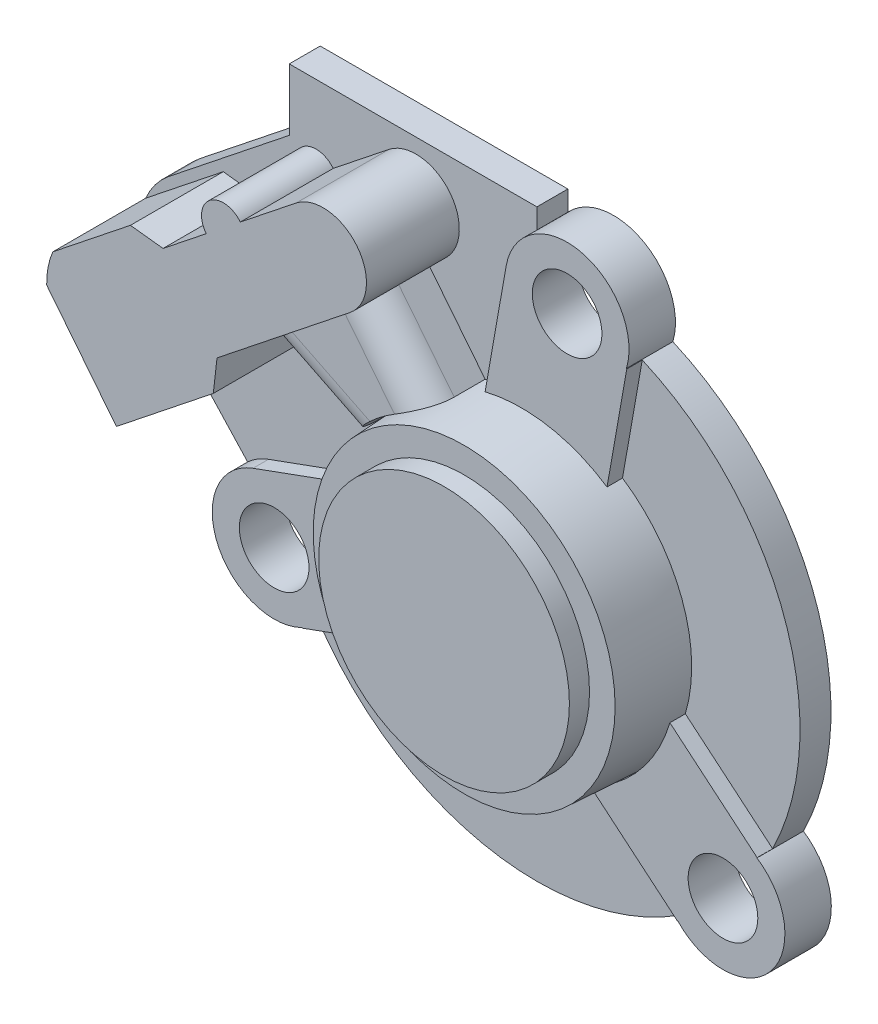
ISO-10303-21;
HEADER;
FILE_DESCRIPTION(('STEP AP214'),'2;1');
FILE_NAME('part.step','',(''),(''),'','','');
FILE_SCHEMA(('AUTOMOTIVE_DESIGN { 1 0 10303 214 1 1 1 1 }'));
ENDSEC;
DATA;
#1=APPLICATION_CONTEXT('core data for automotive mechanical design processes');
#2=APPLICATION_PROTOCOL_DEFINITION('international standard','automotive_design',2000,#1);
#3=PRODUCT_CONTEXT('',#1,'mechanical');
#4=PRODUCT('Part','Part','',(#3));
#5=PRODUCT_RELATED_PRODUCT_CATEGORY('part','',(#4));
#6=PRODUCT_DEFINITION_FORMATION('','',#4);
#7=PRODUCT_DEFINITION_CONTEXT('part definition',#1,'design');
#8=PRODUCT_DEFINITION('design','',#6,#7);
#9=PRODUCT_DEFINITION_SHAPE('','',#8);
#10=(LENGTH_UNIT() NAMED_UNIT(*) SI_UNIT(.MILLI.,.METRE.));
#11=(NAMED_UNIT(*) PLANE_ANGLE_UNIT() SI_UNIT($,.RADIAN.));
#12=(NAMED_UNIT(*) SI_UNIT($,.STERADIAN.) SOLID_ANGLE_UNIT());
#13=UNCERTAINTY_MEASURE_WITH_UNIT(LENGTH_MEASURE(1.E-05),#10,'distance_accuracy_value','');
#14=(GEOMETRIC_REPRESENTATION_CONTEXT(3) GLOBAL_UNCERTAINTY_ASSIGNED_CONTEXT((#13)) GLOBAL_UNIT_ASSIGNED_CONTEXT((#10,
#11,#12)) REPRESENTATION_CONTEXT('',''));
#15=CARTESIAN_POINT('',(0.,0.,0.));
#16=DIRECTION('',(0.,0.,1.));
#17=DIRECTION('',(1.,0.,0.));
#18=AXIS2_PLACEMENT_3D('',#15,#16,#17);
#19=CARTESIAN_POINT('',(45.1267754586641,51.2332865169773,2.));
#20=DIRECTION('',(0.,0.,1.));
#21=DIRECTION('',(1.,0.,0.));
#22=AXIS2_PLACEMENT_3D('',#19,#20,#21);
#23=PLANE('',#22);
#24=DIRECTION('',(-0.78249546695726,-0.622656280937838,0.));
#25=VECTOR('',#24,1.);
#26=CARTESIAN_POINT('',(-5.78251811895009,7.26692134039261,2.));
#27=LINE('',#26,#25);
#28=CARTESIAN_POINT('',(59.7304230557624,59.3976313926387,2.));
#29=VERTEX_POINT('',#28);
#30=CARTESIAN_POINT('',(58.7808921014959,58.642059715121,2.));
#31=VERTEX_POINT('',#30);
#32=EDGE_CURVE('E353',#29,#31,#27,.T.);
#33=ORIENTED_EDGE('',*,*,#32,.T.);
#34=DIRECTION('',(-0.622656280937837,0.782495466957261,0.));
#35=VECTOR('',#34,1.);
#36=CARTESIAN_POINT('',(64.5634102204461,51.3751383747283,2.));
#37=LINE('',#36,#35);
#38=CARTESIAN_POINT('',(62.4555157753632,54.0241405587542,2.));
#39=VERTEX_POINT('',#38);
#40=EDGE_CURVE('E798',#39,#31,#37,.T.);
#41=ORIENTED_EDGE('',*,*,#40,.F.);
#42=CARTESIAN_POINT('',(65.8,44.6,2.));
#43=DIRECTION('',(0.,0.,1.));
#44=DIRECTION('',(1.,0.,0.));
#45=AXIS2_PLACEMENT_3D('',#42,#43,#44);
#46=CIRCLE('',#45,9.99999999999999);
#47=CARTESIAN_POINT('',(63.452280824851,54.3205048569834,2.));
#48=VERTEX_POINT('',#47);
#49=EDGE_CURVE('E508',#48,#39,#46,.T.);
#50=ORIENTED_EDGE('',*,*,#49,.F.);
#51=DIRECTION('',(0.173648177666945,0.984807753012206,0.));
#52=VECTOR('',#51,1.);
#53=CARTESIAN_POINT('',(52.2496070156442,-9.21301544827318,2.));
#54=LINE('',#53,#52);
#55=CARTESIAN_POINT('',(64.8127880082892,62.0363245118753,2.));
#56=VERTEX_POINT('',#55);
#57=EDGE_CURVE('E479',#48,#56,#54,.T.);
#58=ORIENTED_EDGE('',*,*,#57,.T.);
#59=CARTESIAN_POINT('',(68.7520190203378,61.3417318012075,2.));
#60=DIRECTION('',(0.,0.,1.));
#61=DIRECTION('',(1.,0.,0.));
#62=AXIS2_PLACEMENT_3D('',#59,#60,#61);
#63=CIRCLE('',#62,3.99999999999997);
#64=CARTESIAN_POINT('',(65.8,64.0409138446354,2.));
#65=VERTEX_POINT('',#64);
#66=EDGE_CURVE('E463',#65,#56,#63,.T.);
#67=ORIENTED_EDGE('',*,*,#66,.F.);
#68=DIRECTION('',(0.,1.,0.));
#69=VECTOR('',#68,1.);
#70=CARTESIAN_POINT('',(65.8,64.0409138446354,2.));
#71=LINE('',#70,#69);
#72=CARTESIAN_POINT('',(65.8,65.3417318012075,2.));
#73=VERTEX_POINT('',#72);
#74=EDGE_CURVE('E522',#65,#73,#71,.T.);
#75=ORIENTED_EDGE('',*,*,#74,.T.);
#76=DIRECTION('',(-1.,0.,0.));
#77=VECTOR('',#76,1.);
#78=CARTESIAN_POINT('',(65.8,65.3417318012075,2.));
#79=LINE('',#78,#77);
#80=CARTESIAN_POINT('',(49.8,65.3417318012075,2.));
#81=VERTEX_POINT('',#80);
#82=EDGE_CURVE('E524',#73,#81,#79,.T.);
#83=ORIENTED_EDGE('',*,*,#82,.T.);
#84=DIRECTION('',(0.,-1.,0.));
#85=VECTOR('',#84,1.);
#86=CARTESIAN_POINT('',(49.8,65.3417318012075,2.));
#87=LINE('',#86,#85);
#88=CARTESIAN_POINT('',(49.8,61.3417318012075,2.));
#89=VERTEX_POINT('',#88);
#90=EDGE_CURVE('E526',#81,#89,#87,.T.);
#91=ORIENTED_EDGE('',*,*,#90,.T.);
#92=DIRECTION('',(-0.78249546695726,-0.622656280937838,0.));
#93=VECTOR('',#92,1.);
#94=CARTESIAN_POINT('',(49.8,61.3417318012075,2.));
#95=LINE('',#94,#93);
#96=CARTESIAN_POINT('',(42.0134940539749,55.1457638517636,2.));
#97=VERTEX_POINT('',#96);
#98=EDGE_CURVE('E528',#89,#97,#95,.T.);
#99=ORIENTED_EDGE('',*,*,#98,.T.);
#100=CARTESIAN_POINT('',(45.1267754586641,51.2332865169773,2.));
#101=DIRECTION('',(0.,0.,1.));
#102=DIRECTION('',(1.,0.,0.));
#103=AXIS2_PLACEMENT_3D('',#100,#101,#102);
#104=CIRCLE('',#103,5.);
#105=CARTESIAN_POINT('',(40.5250650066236,53.1888582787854,2.));
#106=VERTEX_POINT('',#105);
#107=EDGE_CURVE('E513',#97,#106,#104,.T.);
#108=ORIENTED_EDGE('',*,*,#107,.T.);
#109=DIRECTION('',(0.78249546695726,0.622656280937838,0.));
#110=VECTOR('',#109,1.);
#111=CARTESIAN_POINT('',(-10.2033777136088,12.8226391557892,2.));
#112=LINE('',#111,#110);
#113=CARTESIAN_POINT('',(45.5378788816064,57.1777121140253,2.));
#114=VERTEX_POINT('',#113);
#115=EDGE_CURVE('E306',#106,#114,#112,.T.);
#116=ORIENTED_EDGE('',*,*,#115,.T.);
#117=DIRECTION('',(0.993592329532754,-0.113023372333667,0.));
#118=VECTOR('',#117,1.);
#119=CARTESIAN_POINT('',(7.00272253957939,61.5611732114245,2.));
#120=LINE('',#119,#118);
#121=CARTESIAN_POINT('',(47.645606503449,56.9379533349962,2.));
#122=VERTEX_POINT('',#121);
#123=EDGE_CURVE('E366',#114,#122,#120,.T.);
#124=ORIENTED_EDGE('',*,*,#123,.T.);
#125=DIRECTION('',(-0.78249546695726,-0.622656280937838,0.));
#126=VECTOR('',#125,1.);
#127=CARTESIAN_POINT('',(-9.26939329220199,11.6488959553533,2.));
#128=LINE('',#127,#126);
#129=CARTESIAN_POINT('',(50.4362030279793,59.158518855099,2.));
#130=VERTEX_POINT('',#129);
#131=EDGE_CURVE('E363',#130,#122,#128,.T.);
#132=ORIENTED_EDGE('',*,*,#131,.F.);
#133=CARTESIAN_POINT('',(51.5372614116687,60.0346656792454,2.));
#134=DIRECTION('',(0.,0.,1.));
#135=DIRECTION('',(1.,0.,0.));
#136=AXIS2_PLACEMENT_3D('',#133,#134,#135);
#137=CIRCLE('',#136,1.40711151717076);
#138=CARTESIAN_POINT('',(52.6383197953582,60.9108125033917,2.));
#139=VERTEX_POINT('',#138);
#140=EDGE_CURVE('E362',#139,#130,#137,.T.);
#141=ORIENTED_EDGE('',*,*,#140,.F.);
#142=CARTESIAN_POINT('',(56.2435478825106,63.7796060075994,2.));
#143=VERTEX_POINT('',#142);
#144=EDGE_CURVE('E359',#143,#139,#128,.T.);
#145=ORIENTED_EDGE('',*,*,#144,.F.);
#146=CARTESIAN_POINT('',(57.9869854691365,61.588618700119,2.));
#147=DIRECTION('',(0.,0.,1.));
#148=DIRECTION('',(1.,0.,0.));
#149=AXIS2_PLACEMENT_3D('',#146,#147,#148);
#150=CIRCLE('',#149,2.8);
#151=EDGE_CURVE('E356',#29,#143,#150,.T.);
#152=ORIENTED_EDGE('',*,*,#151,.F.);
#153=EDGE_LOOP('',(#33,#41,#50,#58,#67,#75,#83,#91,#99,#108,#116,#124,#132,#141,#145,#152));
#154=FACE_BOUND('',#153,.T.);
#155=ADVANCED_FACE('F36',(#154),#23,.T.);
#156=CARTESIAN_POINT('',(-5.78251811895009,7.26692134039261,8.));
#157=DIRECTION('',(0.622656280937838,-0.78249546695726,0.));
#158=DIRECTION('',(0.78249546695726,0.622656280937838,0.));
#159=AXIS2_PLACEMENT_3D('',#156,#157,#158);
#160=PLANE('',#159);
#161=DIRECTION('',(-0.78249546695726,-0.622656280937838,0.));
#162=VECTOR('',#161,1.);
#163=CARTESIAN_POINT('',(-5.78251811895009,7.26692134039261,6.));
#164=LINE('',#163,#162);
#165=CARTESIAN_POINT('',(57.2159011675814,57.3967471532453,6.));
#166=VERTEX_POINT('',#165);
#167=CARTESIAN_POINT('',(53.6779768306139,54.5815093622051,6.));
#168=VERTEX_POINT('',#167);
#169=EDGE_CURVE('E875',#166,#168,#164,.T.);
#170=ORIENTED_EDGE('',*,*,#169,.F.);
#171=CARTESIAN_POINT('',(57.2159011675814,57.3967471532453,4.));
#172=DIRECTION('',(0.622656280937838,-0.78249546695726,0.));
#173=DIRECTION('',(0.78249546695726,0.622656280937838,0.));
#174=AXIS2_PLACEMENT_3D('',#171,#172,#173);
#175=CIRCLE('',#174,2.);
#176=CARTESIAN_POINT('',(58.7808921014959,58.642059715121,4.));
#177=VERTEX_POINT('',#176);
#178=EDGE_CURVE('E11',#166,#177,#175,.F.);
#179=ORIENTED_EDGE('',*,*,#178,.T.);
#180=DIRECTION('',(0.,0.,-1.));
#181=VECTOR('',#180,1.);
#182=CARTESIAN_POINT('',(58.7808921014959,58.642059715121,6.));
#183=LINE('',#182,#181);
#184=EDGE_CURVE('E880',#177,#31,#183,.T.);
#185=ORIENTED_EDGE('',*,*,#184,.T.);
#186=ORIENTED_EDGE('',*,*,#32,.F.);
#187=DIRECTION('',(0.,0.,-1.));
#188=VECTOR('',#187,1.);
#189=CARTESIAN_POINT('',(59.7304230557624,59.3976313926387,8.));
#190=LINE('',#189,#188);
#191=CARTESIAN_POINT('',(59.7304230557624,59.3976313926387,8.));
#192=VERTEX_POINT('',#191);
#193=EDGE_CURVE('E385',#192,#29,#190,.T.);
#194=ORIENTED_EDGE('',*,*,#193,.F.);
#195=DIRECTION('',(-0.78249546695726,-0.622656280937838,0.));
#196=VECTOR('',#195,1.);
#197=CARTESIAN_POINT('',(-5.78251811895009,7.26692134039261,8.));
#198=LINE('',#197,#196);
#199=CARTESIAN_POINT('',(51.1324816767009,52.5559787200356,8.));
#200=VERTEX_POINT('',#199);
#201=EDGE_CURVE('E330',#192,#200,#198,.T.);
#202=ORIENTED_EDGE('',*,*,#201,.T.);
#203=DIRECTION('',(0.,0.,-1.));
#204=VECTOR('',#203,1.);
#205=CARTESIAN_POINT('',(51.1324816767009,52.5559787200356,8.));
#206=LINE('',#205,#204);
#207=CARTESIAN_POINT('',(51.1324816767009,52.5559787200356,2.));
#208=VERTEX_POINT('',#207);
#209=EDGE_CURVE('E388',#200,#208,#206,.T.);
#210=ORIENTED_EDGE('',*,*,#209,.T.);
#211=CARTESIAN_POINT('',(51.9490426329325,53.2057419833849,2.));
#212=VERTEX_POINT('',#211);
#213=EDGE_CURVE('E352',#212,#208,#27,.T.);
#214=ORIENTED_EDGE('',*,*,#213,.F.);
#215=DIRECTION('',(0.,0.,-1.));
#216=VECTOR('',#215,1.);
#217=CARTESIAN_POINT('',(51.9490426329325,53.2057419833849,6.));
#218=LINE('',#217,#216);
#219=CARTESIAN_POINT('',(51.9490426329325,53.2057419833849,4.));
#220=VERTEX_POINT('',#219);
#221=EDGE_CURVE('E801',#220,#212,#218,.T.);
#222=ORIENTED_EDGE('',*,*,#221,.F.);
#223=CARTESIAN_POINT('',(53.6779768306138,54.5815093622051,4.));
#224=DIRECTION('',(0.622656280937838,-0.78249546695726,0.));
#225=DIRECTION('',(-0.78249546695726,-0.622656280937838,0.));
#226=AXIS2_PLACEMENT_3D('',#223,#224,#225);
#227=ELLIPSE('',#226,2.2095133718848,2.);
#228=EDGE_CURVE('E46',#220,#168,#227,.F.);
#229=ORIENTED_EDGE('',*,*,#228,.T.);
#230=EDGE_LOOP('',(#170,#179,#185,#186,#194,#202,#210,#214,#222,#229));
#231=FACE_BOUND('',#230,.T.);
#232=ADVANCED_FACE('F636',(#231),#160,.T.);
#233=DIRECTION('',(-0.896202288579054,0.443645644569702,0.));
#234=VECTOR('',#233,1.);
#235=CARTESIAN_POINT('',(31.3790893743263,63.3884544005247,2.));
#236=LINE('',#235,#234);
#237=CARTESIAN_POINT('',(57.6442176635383,50.3864682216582,2.));
#238=VERTEX_POINT('',#237);
#239=EDGE_CURVE('E791',#238,#212,#236,.T.);
#240=ORIENTED_EDGE('',*,*,#239,.T.);
#241=ORIENTED_EDGE('',*,*,#213,.T.);
#242=DIRECTION('',(-0.113023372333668,-0.993592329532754,0.));
#243=VECTOR('',#242,1.);
#244=CARTESIAN_POINT('',(44.5773088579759,-5.07076959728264,2.));
#245=LINE('',#244,#243);
#246=CARTESIAN_POINT('',(50.8927228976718,50.4482510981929,2.));
#247=VERTEX_POINT('',#246);
#248=EDGE_CURVE('E350',#208,#247,#245,.T.);
#249=ORIENTED_EDGE('',*,*,#248,.T.);
#250=DIRECTION('',(-0.78249546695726,-0.622656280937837,0.));
#251=VECTOR('',#250,1.);
#252=CARTESIAN_POINT('',(-4.84853369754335,6.09317813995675,2.));
#253=LINE('',#252,#251);
#254=CARTESIAN_POINT('',(44.6327591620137,45.4670008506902,2.));
#255=VERTEX_POINT('',#254);
#256=EDGE_CURVE('E347',#247,#255,#253,.T.);
#257=ORIENTED_EDGE('',*,*,#256,.T.);
#258=DIRECTION('',(-0.622656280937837,0.782495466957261,0.));
#259=VECTOR('',#258,1.);
#260=CARTESIAN_POINT('',(49.4812928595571,39.3738227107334,2.));
#261=LINE('',#260,#259);
#262=CARTESIAN_POINT('',(40.1278775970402,51.128309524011,2.));
#263=VERTEX_POINT('',#262);
#264=EDGE_CURVE('E345',#255,#263,#261,.T.);
#265=ORIENTED_EDGE('',*,*,#264,.T.);
#266=CARTESIAN_POINT('',(41.4553604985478,47.8390690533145,2.));
#267=VERTEX_POINT('',#266);
#268=EDGE_CURVE('E313',#263,#267,#104,.T.);
#269=ORIENTED_EDGE('',*,*,#268,.T.);
#270=DIRECTION('',(0.678843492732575,-0.734282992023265,0.));
#271=VECTOR('',#270,1.);
#272=CARTESIAN_POINT('',(41.4553604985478,47.8390690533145,2.));
#273=LINE('',#272,#271);
#274=CARTESIAN_POINT('',(47.1098514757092,41.7227895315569,2.));
#275=VERTEX_POINT('',#274);
#276=EDGE_CURVE('E515',#267,#275,#273,.T.);
#277=ORIENTED_EDGE('',*,*,#276,.T.);
#278=CARTESIAN_POINT('',(49.8252254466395,38.7856575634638,2.));
#279=DIRECTION('',(0.,0.,1.));
#280=DIRECTION('',(1.,0.,0.));
#281=AXIS2_PLACEMENT_3D('',#278,#279,#280);
#282=CIRCLE('',#281,4.00000000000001);
#283=CARTESIAN_POINT('',(48.4571448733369,42.5444280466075,2.));
#284=VERTEX_POINT('',#283);
#285=EDGE_CURVE('E412',#284,#275,#282,.T.);
#286=ORIENTED_EDGE('',*,*,#285,.F.);
#287=DIRECTION('',(-0.939692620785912,-0.342020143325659,0.));
#288=VECTOR('',#287,1.);
#289=CARTESIAN_POINT('',(-8.00510644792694,21.9938492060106,2.));
#290=LINE('',#289,#288);
#291=CARTESIAN_POINT('',(55.8194942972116,45.2241040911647,2.));
#292=VERTEX_POINT('',#291);
#293=EDGE_CURVE('E317',#292,#284,#290,.T.);
#294=ORIENTED_EDGE('',*,*,#293,.F.);
#295=EDGE_CURVE('E509',#238,#292,#46,.T.);
#296=ORIENTED_EDGE('',*,*,#295,.F.);
#297=EDGE_LOOP('',(#240,#241,#249,#257,#265,#269,#277,#286,#294,#296));
#298=FACE_BOUND('',#297,.T.);
#299=ADVANCED_FACE('F639',(#298),#23,.T.);
#300=DIRECTION('',(-0.939692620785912,-0.342020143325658,0.));
#301=VECTOR('',#300,1.);
#302=CARTESIAN_POINT('',(-5.26894530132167,14.4763082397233,2.));
#303=LINE('',#302,#301);
#304=CARTESIAN_POINT('',(58.5556554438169,37.7065631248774,2.));
#305=VERTEX_POINT('',#304);
#306=CARTESIAN_POINT('',(51.6418103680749,35.1901293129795,2.));
#307=VERTEX_POINT('',#306);
#308=EDGE_CURVE('E414',#305,#307,#303,.T.);
#309=ORIENTED_EDGE('',*,*,#308,.T.);
#310=CARTESIAN_POINT('',(65.8,44.6,2.));
#311=DIRECTION('',(0.,0.,1.));
#312=DIRECTION('',(1.,0.,0.));
#313=AXIS2_PLACEMENT_3D('',#310,#311,#312);
#314=CIRCLE('',#313,17.);
#315=CARTESIAN_POINT('',(75.8859809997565,30.915227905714,2.));
#316=VERTEX_POINT('',#315);
#317=EDGE_CURVE('E518',#307,#316,#314,.T.);
#318=ORIENTED_EDGE('',*,*,#317,.T.);
#319=DIRECTION('',(0.766044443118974,-0.642787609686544,0.));
#320=VECTOR('',#319,1.);
#321=CARTESIAN_POINT('',(46.5770374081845,55.5083516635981,2.));
#322=LINE('',#321,#320);
#323=CARTESIAN_POINT('',(70.2497628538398,35.6445764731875,2.));
#324=VERTEX_POINT('',#323);
#325=EDGE_CURVE('E433',#324,#316,#322,.T.);
#326=ORIENTED_EDGE('',*,*,#325,.F.);
#327=EDGE_CURVE('E841',#305,#324,#46,.T.);
#328=ORIENTED_EDGE('',*,*,#327,.F.);
#329=EDGE_LOOP('',(#309,#318,#326,#328));
#330=FACE_BOUND('',#329,.T.);
#331=ADVANCED_FACE('F717',(#330),#23,.T.);
#332=DIRECTION('',(0.766044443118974,-0.642787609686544,0.));
#333=VECTOR('',#332,1.);
#334=CARTESIAN_POINT('',(51.7193382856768,61.6367072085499,2.));
#335=LINE('',#334,#333);
#336=CARTESIAN_POINT('',(75.3920637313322,41.7729320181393,2.));
#337=VERTEX_POINT('',#336);
#338=CARTESIAN_POINT('',(81.0282818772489,37.0435834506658,2.));
#339=VERTEX_POINT('',#338);
#340=EDGE_CURVE('E428',#337,#339,#335,.T.);
#341=ORIENTED_EDGE('',*,*,#340,.T.);
#342=CARTESIAN_POINT('',(65.8,44.6,2.));
#343=DIRECTION('',(0.,0.,1.));
#344=DIRECTION('',(1.,0.,0.));
#345=AXIS2_PLACEMENT_3D('',#342,#343,#344);
#346=CIRCLE('',#345,17.);
#347=CARTESIAN_POINT('',(72.6083697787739,60.1771018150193,2.));
#348=VERTEX_POINT('',#347);
#349=EDGE_CURVE('E520',#339,#348,#346,.T.);
#350=ORIENTED_EDGE('',*,*,#349,.T.);
#351=DIRECTION('',(0.173648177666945,0.984807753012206,0.));
#352=VECTOR('',#351,1.);
#353=CARTESIAN_POINT('',(60.1280690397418,-10.6022008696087,2.));
#354=LINE('',#353,#352);
#355=CARTESIAN_POINT('',(71.3307428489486,52.9313194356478,2.));
#356=VERTEX_POINT('',#355);
#357=EDGE_CURVE('E467',#356,#348,#354,.T.);
#358=ORIENTED_EDGE('',*,*,#357,.F.);
#359=EDGE_CURVE('E498',#337,#356,#46,.T.);
#360=ORIENTED_EDGE('',*,*,#359,.F.);
#361=EDGE_LOOP('',(#341,#350,#358,#360));
#362=FACE_BOUND('',#361,.T.);
#363=ADVANCED_FACE('F714',(#362),#23,.T.);
#364=CARTESIAN_POINT('',(45.1267754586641,51.2332865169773,2.));
#365=DIRECTION('',(0.,0.,-1.));
#366=DIRECTION('',(-1.,0.,0.));
#367=AXIS2_PLACEMENT_3D('',#364,#365,#366);
#368=CYLINDRICAL_SURFACE('',#367,5.);
#369=CARTESIAN_POINT('',(45.1267754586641,51.2332865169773,0.));
#370=DIRECTION('',(0.,0.,1.));
#371=DIRECTION('',(1.,0.,0.));
#372=AXIS2_PLACEMENT_3D('',#369,#370,#371);
#373=CIRCLE('',#372,5.);
#374=CARTESIAN_POINT('',(42.0134940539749,55.1457638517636,0.));
#375=VERTEX_POINT('',#374);
#376=CARTESIAN_POINT('',(41.4553604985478,47.8390690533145,0.));
#377=VERTEX_POINT('',#376);
#378=EDGE_CURVE('E512',#375,#377,#373,.T.);
#379=ORIENTED_EDGE('',*,*,#378,.T.);
#380=DIRECTION('',(0.,0.,-1.));
#381=VECTOR('',#380,1.);
#382=CARTESIAN_POINT('',(41.4553604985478,47.8390690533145,2.));
#383=LINE('',#382,#381);
#384=EDGE_CURVE('E503',#267,#377,#383,.T.);
#385=ORIENTED_EDGE('',*,*,#384,.F.);
#386=ORIENTED_EDGE('',*,*,#268,.F.);
#387=DIRECTION('',(0.,0.,-1.));
#388=VECTOR('',#387,1.);
#389=CARTESIAN_POINT('',(40.1278775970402,51.128309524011,8.));
#390=LINE('',#389,#388);
#391=CARTESIAN_POINT('',(40.1278775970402,51.128309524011,8.));
#392=VERTEX_POINT('',#391);
#393=EDGE_CURVE('E309',#392,#263,#390,.T.);
#394=ORIENTED_EDGE('',*,*,#393,.F.);
#395=CARTESIAN_POINT('',(45.1267754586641,51.2332865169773,8.));
#396=DIRECTION('',(0.,0.,1.));
#397=DIRECTION('',(1.,0.,0.));
#398=AXIS2_PLACEMENT_3D('',#395,#396,#397);
#399=CIRCLE('',#398,5.);
#400=CARTESIAN_POINT('',(40.5250650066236,53.1888582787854,8.));
#401=VERTEX_POINT('',#400);
#402=EDGE_CURVE('E294',#401,#392,#399,.T.);
#403=ORIENTED_EDGE('',*,*,#402,.F.);
#404=DIRECTION('',(0.,0.,-1.));
#405=VECTOR('',#404,1.);
#406=CARTESIAN_POINT('',(40.5250650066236,53.1888582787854,8.));
#407=LINE('',#406,#405);
#408=EDGE_CURVE('E344',#401,#106,#407,.T.);
#409=ORIENTED_EDGE('',*,*,#408,.T.);
#410=ORIENTED_EDGE('',*,*,#107,.F.);
#411=DIRECTION('',(0.,0.,-1.));
#412=VECTOR('',#411,1.);
#413=CARTESIAN_POINT('',(42.0134940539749,55.1457638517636,2.));
#414=LINE('',#413,#412);
#415=EDGE_CURVE('E530',#97,#375,#414,.T.);
#416=ORIENTED_EDGE('',*,*,#415,.T.);
#417=EDGE_LOOP('',(#379,#385,#386,#394,#403,#409,#410,#416));
#418=FACE_BOUND('',#417,.T.);
#419=ADVANCED_FACE('F311',(#418),#368,.T.);
#420=CARTESIAN_POINT('',(41.4553604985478,47.8390690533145,2.));
#421=DIRECTION('',(0.734282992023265,0.678843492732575,0.));
#422=DIRECTION('',(-0.678843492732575,0.734282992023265,0.));
#423=AXIS2_PLACEMENT_3D('',#420,#421,#422);
#424=PLANE('',#423);
#425=DIRECTION('',(0.678843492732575,-0.734282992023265,0.));
#426=VECTOR('',#425,1.);
#427=CARTESIAN_POINT('',(41.4553604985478,47.8390690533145,0.));
#428=LINE('',#427,#426);
#429=CARTESIAN_POINT('',(47.1098514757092,41.7227895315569,0.));
#430=VERTEX_POINT('',#429);
#431=EDGE_CURVE('E532',#377,#430,#428,.T.);
#432=ORIENTED_EDGE('',*,*,#431,.T.);
#433=DIRECTION('',(0.,0.,-1.));
#434=VECTOR('',#433,1.);
#435=CARTESIAN_POINT('',(47.1098514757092,41.7227895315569,2.));
#436=LINE('',#435,#434);
#437=EDGE_CURVE('E578',#275,#430,#436,.T.);
#438=ORIENTED_EDGE('',*,*,#437,.F.);
#439=ORIENTED_EDGE('',*,*,#276,.F.);
#440=ORIENTED_EDGE('',*,*,#384,.T.);
#441=EDGE_LOOP('',(#432,#438,#439,#440));
#442=FACE_BOUND('',#441,.T.);
#443=ADVANCED_FACE('F757',(#442),#424,.F.);
#444=CARTESIAN_POINT('',(49.8252254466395,38.7856575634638,2.));
#445=DIRECTION('',(0.,0.,-1.));
#446=DIRECTION('',(-1.,0.,0.));
#447=AXIS2_PLACEMENT_3D('',#444,#445,#446);
#448=CYLINDRICAL_SURFACE('',#447,4.);
#449=CARTESIAN_POINT('',(49.8252254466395,38.7856575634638,0.));
#450=DIRECTION('',(0.,0.,1.));
#451=DIRECTION('',(1.,0.,0.));
#452=AXIS2_PLACEMENT_3D('',#449,#450,#451);
#453=CIRCLE('',#452,4.);
#454=CARTESIAN_POINT('',(51.6260136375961,35.2139406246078,0.));
#455=VERTEX_POINT('',#454);
#456=EDGE_CURVE('E534',#430,#455,#453,.T.);
#457=ORIENTED_EDGE('',*,*,#456,.T.);
#458=DIRECTION('',(0.,0.,-1.));
#459=VECTOR('',#458,1.);
#460=CARTESIAN_POINT('',(51.6260136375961,35.2139406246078,2.));
#461=LINE('',#460,#459);
#462=CARTESIAN_POINT('',(51.6260136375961,35.2139406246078,3.));
#463=VERTEX_POINT('',#462);
#464=EDGE_CURVE('E575',#463,#455,#461,.T.);
#465=ORIENTED_EDGE('',*,*,#464,.F.);
#466=CARTESIAN_POINT('',(49.8252254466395,38.7856575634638,3.));
#467=DIRECTION('',(0.,0.,1.));
#468=DIRECTION('',(1.,0.,0.));
#469=AXIS2_PLACEMENT_3D('',#466,#467,#468);
#470=CIRCLE('',#469,4.00000000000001);
#471=CARTESIAN_POINT('',(48.4571448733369,42.5444280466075,3.));
#472=VERTEX_POINT('',#471);
#473=EDGE_CURVE('E398',#472,#463,#470,.T.);
#474=ORIENTED_EDGE('',*,*,#473,.F.);
#475=DIRECTION('',(0.,0.,-1.));
#476=VECTOR('',#475,1.);
#477=CARTESIAN_POINT('',(48.4571448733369,42.5444280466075,3.));
#478=LINE('',#477,#476);
#479=EDGE_CURVE('E426',#472,#284,#478,.T.);
#480=ORIENTED_EDGE('',*,*,#479,.T.);
#481=ORIENTED_EDGE('',*,*,#285,.T.);
#482=ORIENTED_EDGE('',*,*,#437,.T.);
#483=EDGE_LOOP('',(#457,#465,#474,#480,#481,#482));
#484=FACE_BOUND('',#483,.T.);
#485=ADVANCED_FACE('F753',(#484),#448,.T.);
#486=CARTESIAN_POINT('',(65.8,44.6,2.));
#487=DIRECTION('',(0.,0.,-1.));
#488=DIRECTION('',(-1.,0.,0.));
#489=AXIS2_PLACEMENT_3D('',#486,#487,#488);
#490=CYLINDRICAL_SURFACE('',#489,17.);
#491=CARTESIAN_POINT('',(65.8,44.6,0.));
#492=DIRECTION('',(0.,0.,1.));
#493=DIRECTION('',(1.,0.,0.));
#494=AXIS2_PLACEMENT_3D('',#491,#492,#493);
#495=CIRCLE('',#494,17.);
#496=CARTESIAN_POINT('',(75.9089690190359,30.9322004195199,0.));
#497=VERTEX_POINT('',#496);
#498=EDGE_CURVE('E536',#455,#497,#495,.T.);
#499=ORIENTED_EDGE('',*,*,#498,.T.);
#500=DIRECTION('',(0.,0.,-1.));
#501=VECTOR('',#500,1.);
#502=CARTESIAN_POINT('',(75.9089690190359,30.9322004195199,2.));
#503=LINE('',#502,#501);
#504=CARTESIAN_POINT('',(75.9089690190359,30.9322004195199,3.));
#505=VERTEX_POINT('',#504);
#506=EDGE_CURVE('E572',#505,#497,#503,.T.);
#507=ORIENTED_EDGE('',*,*,#506,.F.);
#508=CARTESIAN_POINT('',(65.8,44.6,3.));
#509=DIRECTION('',(0.,0.,1.));
#510=DIRECTION('',(1.,0.,0.));
#511=AXIS2_PLACEMENT_3D('',#508,#509,#510);
#512=CIRCLE('',#511,17.);
#513=CARTESIAN_POINT('',(75.8859809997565,30.915227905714,3.));
#514=VERTEX_POINT('',#513);
#515=EDGE_CURVE('E437',#514,#505,#512,.T.);
#516=ORIENTED_EDGE('',*,*,#515,.F.);
#517=DIRECTION('',(0.,0.,-1.));
#518=VECTOR('',#517,1.);
#519=CARTESIAN_POINT('',(75.8859809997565,30.915227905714,3.));
#520=LINE('',#519,#518);
#521=EDGE_CURVE('E454',#514,#316,#520,.T.);
#522=ORIENTED_EDGE('',*,*,#521,.T.);
#523=ORIENTED_EDGE('',*,*,#317,.F.);
#524=DIRECTION('',(0.,0.,-1.));
#525=VECTOR('',#524,1.);
#526=CARTESIAN_POINT('',(51.6418103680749,35.1901293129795,3.));
#527=LINE('',#526,#525);
#528=CARTESIAN_POINT('',(51.6418103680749,35.1901293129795,3.));
#529=VERTEX_POINT('',#528);
#530=EDGE_CURVE('E424',#529,#307,#527,.T.);
#531=ORIENTED_EDGE('',*,*,#530,.F.);
#532=CARTESIAN_POINT('',(65.8,44.6,3.));
#533=DIRECTION('',(0.,0.,1.));
#534=DIRECTION('',(1.,0.,0.));
#535=AXIS2_PLACEMENT_3D('',#532,#533,#534);
#536=CIRCLE('',#535,17.);
#537=EDGE_CURVE('E402',#463,#529,#536,.T.);
#538=ORIENTED_EDGE('',*,*,#537,.F.);
#539=ORIENTED_EDGE('',*,*,#464,.T.);
#540=EDGE_LOOP('',(#499,#507,#516,#522,#523,#531,#538,#539));
#541=FACE_BOUND('',#540,.T.);
#542=ADVANCED_FACE('F749',(#541),#490,.T.);
#543=CARTESIAN_POINT('',(78.8227555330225,33.6726106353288,2.));
#544=DIRECTION('',(0.,0.,-1.));
#545=DIRECTION('',(-1.,0.,0.));
#546=AXIS2_PLACEMENT_3D('',#543,#544,#545);
#547=CYLINDRICAL_SURFACE('',#546,4.);
#548=CARTESIAN_POINT('',(78.8227555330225,33.6726106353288,0.));
#549=DIRECTION('',(0.,0.,1.));
#550=DIRECTION('',(1.,0.,0.));
#551=AXIS2_PLACEMENT_3D('',#548,#549,#550);
#552=CIRCLE('',#551,4.);
#553=CARTESIAN_POINT('',(81.0155590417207,37.0179974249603,0.));
#554=VERTEX_POINT('',#553);
#555=EDGE_CURVE('E538',#497,#554,#552,.T.);
#556=ORIENTED_EDGE('',*,*,#555,.T.);
#557=DIRECTION('',(0.,0.,-1.));
#558=VECTOR('',#557,1.);
#559=CARTESIAN_POINT('',(81.0155590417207,37.0179974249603,2.));
#560=LINE('',#559,#558);
#561=CARTESIAN_POINT('',(81.0155590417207,37.0179974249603,3.));
#562=VERTEX_POINT('',#561);
#563=EDGE_CURVE('E569',#562,#554,#560,.T.);
#564=ORIENTED_EDGE('',*,*,#563,.F.);
#565=CARTESIAN_POINT('',(78.8227555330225,33.6726106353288,3.));
#566=DIRECTION('',(0.,0.,1.));
#567=DIRECTION('',(1.,0.,0.));
#568=AXIS2_PLACEMENT_3D('',#565,#566,#567);
#569=CIRCLE('',#568,4.);
#570=EDGE_CURVE('E440',#505,#562,#569,.T.);
#571=ORIENTED_EDGE('',*,*,#570,.F.);
#572=ORIENTED_EDGE('',*,*,#506,.T.);
#573=EDGE_LOOP('',(#556,#564,#571,#572));
#574=FACE_BOUND('',#573,.T.);
#575=ADVANCED_FACE('F745',(#574),#547,.T.);
#576=CARTESIAN_POINT('',(65.8,44.6,2.));
#577=DIRECTION('',(0.,0.,-1.));
#578=DIRECTION('',(-1.,0.,0.));
#579=AXIS2_PLACEMENT_3D('',#576,#577,#578);
#580=CYLINDRICAL_SURFACE('',#579,17.);
#581=CARTESIAN_POINT('',(65.8,44.6,0.));
#582=DIRECTION('',(0.,0.,1.));
#583=DIRECTION('',(1.,0.,0.));
#584=AXIS2_PLACEMENT_3D('',#581,#582,#583);
#585=CIRCLE('',#584,17.);
#586=CARTESIAN_POINT('',(72.582177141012,60.188523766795,0.));
#587=VERTEX_POINT('',#586);
#588=EDGE_CURVE('E540',#554,#587,#585,.T.);
#589=ORIENTED_EDGE('',*,*,#588,.T.);
#590=DIRECTION('',(0.,0.,-1.));
#591=VECTOR('',#590,1.);
#592=CARTESIAN_POINT('',(72.582177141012,60.188523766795,2.));
#593=LINE('',#592,#591);
#594=CARTESIAN_POINT('',(72.582177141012,60.188523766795,3.));
#595=VERTEX_POINT('',#594);
#596=EDGE_CURVE('E566',#595,#587,#593,.T.);
#597=ORIENTED_EDGE('',*,*,#596,.F.);
#598=CARTESIAN_POINT('',(65.8,44.6,3.));
#599=DIRECTION('',(0.,0.,1.));
#600=DIRECTION('',(1.,0.,0.));
#601=AXIS2_PLACEMENT_3D('',#598,#599,#600);
#602=CIRCLE('',#601,17.);
#603=CARTESIAN_POINT('',(72.6083697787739,60.1771018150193,3.));
#604=VERTEX_POINT('',#603);
#605=EDGE_CURVE('E474',#604,#595,#602,.T.);
#606=ORIENTED_EDGE('',*,*,#605,.F.);
#607=DIRECTION('',(0.,0.,-1.));
#608=VECTOR('',#607,1.);
#609=CARTESIAN_POINT('',(72.6083697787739,60.1771018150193,3.));
#610=LINE('',#609,#608);
#611=EDGE_CURVE('E477',#604,#348,#610,.T.);
#612=ORIENTED_EDGE('',*,*,#611,.T.);
#613=ORIENTED_EDGE('',*,*,#349,.F.);
#614=DIRECTION('',(0.,0.,-1.));
#615=VECTOR('',#614,1.);
#616=CARTESIAN_POINT('',(81.0282818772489,37.0435834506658,3.));
#617=LINE('',#616,#615);
#618=CARTESIAN_POINT('',(81.0282818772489,37.0435834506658,3.));
#619=VERTEX_POINT('',#618);
#620=EDGE_CURVE('E445',#619,#339,#617,.T.);
#621=ORIENTED_EDGE('',*,*,#620,.F.);
#622=CARTESIAN_POINT('',(65.8,44.6,3.));
#623=DIRECTION('',(0.,0.,1.));
#624=DIRECTION('',(1.,0.,0.));
#625=AXIS2_PLACEMENT_3D('',#622,#623,#624);
#626=CIRCLE('',#625,17.);
#627=EDGE_CURVE('E443',#562,#619,#626,.T.);
#628=ORIENTED_EDGE('',*,*,#627,.F.);
#629=ORIENTED_EDGE('',*,*,#563,.T.);
#630=EDGE_LOOP('',(#589,#597,#606,#612,#613,#621,#628,#629));
#631=FACE_BOUND('',#630,.T.);
#632=ADVANCED_FACE('F741',(#631),#580,.T.);
#633=CARTESIAN_POINT('',(68.7520190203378,61.3417318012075,2.));
#634=DIRECTION('',(0.,0.,-1.));
#635=DIRECTION('',(-1.,0.,0.));
#636=AXIS2_PLACEMENT_3D('',#633,#634,#635);
#637=CYLINDRICAL_SURFACE('',#636,3.99999999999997);
#638=CARTESIAN_POINT('',(68.7520190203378,61.3417318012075,0.));
#639=DIRECTION('',(0.,0.,1.));
#640=DIRECTION('',(1.,0.,0.));
#641=AXIS2_PLACEMENT_3D('',#638,#639,#640);
#642=CIRCLE('',#641,3.99999999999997);
#643=CARTESIAN_POINT('',(65.8,64.0409138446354,0.));
#644=VERTEX_POINT('',#643);
#645=EDGE_CURVE('E542',#587,#644,#642,.T.);
#646=ORIENTED_EDGE('',*,*,#645,.T.);
#647=DIRECTION('',(0.,0.,-1.));
#648=VECTOR('',#647,1.);
#649=CARTESIAN_POINT('',(65.8,64.0409138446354,2.));
#650=LINE('',#649,#648);
#651=EDGE_CURVE('E563',#65,#644,#650,.T.);
#652=ORIENTED_EDGE('',*,*,#651,.F.);
#653=ORIENTED_EDGE('',*,*,#66,.T.);
#654=DIRECTION('',(0.,0.,-1.));
#655=VECTOR('',#654,1.);
#656=CARTESIAN_POINT('',(64.8127880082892,62.0363245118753,3.));
#657=LINE('',#656,#655);
#658=CARTESIAN_POINT('',(64.8127880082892,62.0363245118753,3.));
#659=VERTEX_POINT('',#658);
#660=EDGE_CURVE('E492',#659,#56,#657,.T.);
#661=ORIENTED_EDGE('',*,*,#660,.F.);
#662=CARTESIAN_POINT('',(68.7520190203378,61.3417318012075,3.));
#663=DIRECTION('',(0.,0.,1.));
#664=DIRECTION('',(1.,0.,0.));
#665=AXIS2_PLACEMENT_3D('',#662,#663,#664);
#666=CIRCLE('',#665,3.99999999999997);
#667=EDGE_CURVE('E464',#595,#659,#666,.T.);
#668=ORIENTED_EDGE('',*,*,#667,.F.);
#669=ORIENTED_EDGE('',*,*,#596,.T.);
#670=EDGE_LOOP('',(#646,#652,#653,#661,#668,#669));
#671=FACE_BOUND('',#670,.T.);
#672=ADVANCED_FACE('F737',(#671),#637,.T.);
#673=CARTESIAN_POINT('',(65.8,64.0409138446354,2.));
#674=DIRECTION('',(-1.,0.,0.));
#675=DIRECTION('',(0.,0.,1.));
#676=AXIS2_PLACEMENT_3D('',#673,#674,#675);
#677=PLANE('',#676);
#678=DIRECTION('',(0.,1.,0.));
#679=VECTOR('',#678,1.);
#680=CARTESIAN_POINT('',(65.8,64.0409138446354,0.));
#681=LINE('',#680,#679);
#682=CARTESIAN_POINT('',(65.8,65.3417318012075,0.));
#683=VERTEX_POINT('',#682);
#684=EDGE_CURVE('E544',#644,#683,#681,.T.);
#685=ORIENTED_EDGE('',*,*,#684,.T.);
#686=DIRECTION('',(0.,0.,-1.));
#687=VECTOR('',#686,1.);
#688=CARTESIAN_POINT('',(65.8,65.3417318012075,2.));
#689=LINE('',#688,#687);
#690=EDGE_CURVE('E560',#73,#683,#689,.T.);
#691=ORIENTED_EDGE('',*,*,#690,.F.);
#692=ORIENTED_EDGE('',*,*,#74,.F.);
#693=ORIENTED_EDGE('',*,*,#651,.T.);
#694=EDGE_LOOP('',(#685,#691,#692,#693));
#695=FACE_BOUND('',#694,.T.);
#696=ADVANCED_FACE('F733',(#695),#677,.F.);
#697=CARTESIAN_POINT('',(65.8,65.3417318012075,2.));
#698=DIRECTION('',(0.,-1.,0.));
#699=DIRECTION('',(0.,0.,-1.));
#700=AXIS2_PLACEMENT_3D('',#697,#698,#699);
#701=PLANE('',#700);
#702=DIRECTION('',(-1.,0.,0.));
#703=VECTOR('',#702,1.);
#704=CARTESIAN_POINT('',(65.8,65.3417318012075,0.));
#705=LINE('',#704,#703);
#706=CARTESIAN_POINT('',(49.8,65.3417318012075,0.));
#707=VERTEX_POINT('',#706);
#708=EDGE_CURVE('E546',#683,#707,#705,.T.);
#709=ORIENTED_EDGE('',*,*,#708,.T.);
#710=DIRECTION('',(0.,0.,-1.));
#711=VECTOR('',#710,1.);
#712=CARTESIAN_POINT('',(49.8,65.3417318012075,2.));
#713=LINE('',#712,#711);
#714=EDGE_CURVE('E557',#81,#707,#713,.T.);
#715=ORIENTED_EDGE('',*,*,#714,.F.);
#716=ORIENTED_EDGE('',*,*,#82,.F.);
#717=ORIENTED_EDGE('',*,*,#690,.T.);
#718=EDGE_LOOP('',(#709,#715,#716,#717));
#719=FACE_BOUND('',#718,.T.);
#720=ADVANCED_FACE('F729',(#719),#701,.F.);
#721=CARTESIAN_POINT('',(49.8,65.3417318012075,2.));
#722=DIRECTION('',(1.,0.,0.));
#723=DIRECTION('',(0.,0.,-1.));
#724=AXIS2_PLACEMENT_3D('',#721,#722,#723);
#725=PLANE('',#724);
#726=DIRECTION('',(0.,-1.,0.));
#727=VECTOR('',#726,1.);
#728=CARTESIAN_POINT('',(49.8,65.3417318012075,0.));
#729=LINE('',#728,#727);
#730=CARTESIAN_POINT('',(49.8,61.3417318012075,0.));
#731=VERTEX_POINT('',#730);
#732=EDGE_CURVE('E548',#707,#731,#729,.T.);
#733=ORIENTED_EDGE('',*,*,#732,.T.);
#734=DIRECTION('',(0.,0.,-1.));
#735=VECTOR('',#734,1.);
#736=CARTESIAN_POINT('',(49.8,61.3417318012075,2.));
#737=LINE('',#736,#735);
#738=EDGE_CURVE('E554',#89,#731,#737,.T.);
#739=ORIENTED_EDGE('',*,*,#738,.F.);
#740=ORIENTED_EDGE('',*,*,#90,.F.);
#741=ORIENTED_EDGE('',*,*,#714,.T.);
#742=EDGE_LOOP('',(#733,#739,#740,#741));
#743=FACE_BOUND('',#742,.T.);
#744=ADVANCED_FACE('F725',(#743),#725,.F.);
#745=CARTESIAN_POINT('',(49.8,61.3417318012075,2.));
#746=DIRECTION('',(0.622656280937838,-0.78249546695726,0.));
#747=DIRECTION('',(0.78249546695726,0.622656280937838,0.));
#748=AXIS2_PLACEMENT_3D('',#745,#746,#747);
#749=PLANE('',#748);
#750=DIRECTION('',(-0.78249546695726,-0.622656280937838,0.));
#751=VECTOR('',#750,1.);
#752=CARTESIAN_POINT('',(49.8,61.3417318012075,0.));
#753=LINE('',#752,#751);
#754=EDGE_CURVE('E550',#731,#375,#753,.T.);
#755=ORIENTED_EDGE('',*,*,#754,.T.);
#756=ORIENTED_EDGE('',*,*,#415,.F.);
#757=ORIENTED_EDGE('',*,*,#98,.F.);
#758=ORIENTED_EDGE('',*,*,#738,.T.);
#759=EDGE_LOOP('',(#755,#756,#757,#758));
#760=FACE_BOUND('',#759,.T.);
#761=ADVANCED_FACE('F721',(#760),#749,.F.);
#762=CARTESIAN_POINT('',(45.1267754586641,51.2332865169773,0.));
#763=DIRECTION('',(0.,0.,1.));
#764=DIRECTION('',(1.,0.,0.));
#765=AXIS2_PLACEMENT_3D('',#762,#763,#764);
#766=PLANE('',#765);
#767=CARTESIAN_POINT('',(68.7520190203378,61.3417318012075,0.));
#768=DIRECTION('',(0.,0.,1.));
#769=DIRECTION('',(1.,0.,0.));
#770=AXIS2_PLACEMENT_3D('',#767,#768,#769);
#771=CIRCLE('',#770,2.25);
#772=CARTESIAN_POINT('',(71.0020190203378,61.3417318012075,0.));
#773=VERTEX_POINT('',#772);
#774=EDGE_CURVE('E894',#773,#773,#771,.T.);
#775=ORIENTED_EDGE('',*,*,#774,.T.);
#776=EDGE_LOOP('',(#775));
#777=FACE_BOUND('',#776,.T.);
#778=CARTESIAN_POINT('',(49.8252254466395,38.7856575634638,0.));
#779=DIRECTION('',(0.,0.,1.));
#780=DIRECTION('',(1.,0.,0.));
#781=AXIS2_PLACEMENT_3D('',#778,#779,#780);
#782=CIRCLE('',#781,2.25);
#783=CARTESIAN_POINT('',(52.0752254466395,38.7856575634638,0.));
#784=VERTEX_POINT('',#783);
#785=EDGE_CURVE('E41',#784,#784,#782,.T.);
#786=ORIENTED_EDGE('',*,*,#785,.T.);
#787=EDGE_LOOP('',(#786));
#788=FACE_BOUND('',#787,.T.);
#789=CARTESIAN_POINT('',(78.8227555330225,33.6726106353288,0.));
#790=DIRECTION('',(0.,0.,1.));
#791=DIRECTION('',(1.,0.,0.));
#792=AXIS2_PLACEMENT_3D('',#789,#790,#791);
#793=CIRCLE('',#792,2.25);
#794=CARTESIAN_POINT('',(81.0727555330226,33.6726106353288,0.));
#795=VERTEX_POINT('',#794);
#796=EDGE_CURVE('E868',#795,#795,#793,.T.);
#797=ORIENTED_EDGE('',*,*,#796,.T.);
#798=EDGE_LOOP('',(#797));
#799=FACE_BOUND('',#798,.T.);
#800=ORIENTED_EDGE('',*,*,#378,.F.);
#801=ORIENTED_EDGE('',*,*,#754,.F.);
#802=ORIENTED_EDGE('',*,*,#732,.F.);
#803=ORIENTED_EDGE('',*,*,#708,.F.);
#804=ORIENTED_EDGE('',*,*,#684,.F.);
#805=ORIENTED_EDGE('',*,*,#645,.F.);
#806=ORIENTED_EDGE('',*,*,#588,.F.);
#807=ORIENTED_EDGE('',*,*,#555,.F.);
#808=ORIENTED_EDGE('',*,*,#498,.F.);
#809=ORIENTED_EDGE('',*,*,#456,.F.);
#810=ORIENTED_EDGE('',*,*,#431,.F.);
#811=EDGE_LOOP('',(#800,#801,#802,#803,#804,#805,#806,#807,#808,#809,#810));
#812=FACE_BOUND('',#811,.T.);
#813=ADVANCED_FACE('F712',(#777,#788,#799,#812),#766,.F.);
#814=CARTESIAN_POINT('',(65.8,44.6,2.));
#815=DIRECTION('',(0.,0.,-1.));
#816=DIRECTION('',(1.,0.,0.));
#817=AXIS2_PLACEMENT_3D('',#814,#815,#816);
#818=CONICAL_SURFACE('',#817,9.99999999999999,0.05235987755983);
#819=CARTESIAN_POINT('',(65.8,44.6,6.7));
#820=DIRECTION('',(0.,0.,1.));
#821=DIRECTION('',(1.,0.,0.));
#822=AXIS2_PLACEMENT_3D('',#819,#820,#821);
#823=CIRCLE('',#822,9.7536834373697);
#824=CARTESIAN_POINT('',(75.5536834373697,44.6,6.7));
#825=VERTEX_POINT('',#824);
#826=EDGE_CURVE('E507',#825,#825,#823,.T.);
#827=ORIENTED_EDGE('',*,*,#826,.F.);
#828=EDGE_LOOP('',(#827));
#829=FACE_BOUND('',#828,.T.);
#830=EDGE_CURVE('E504',#356,#48,#46,.T.);
#831=ORIENTED_EDGE('',*,*,#830,.T.);
#832=ORIENTED_EDGE('',*,*,#49,.T.);
#833=CARTESIAN_POINT('',(65.8,44.6,2.));
#834=DIRECTION('',(0.,0.,1.));
#835=DIRECTION('',(1.,0.,0.));
#836=AXIS2_PLACEMENT_3D('',#833,#834,#835);
#837=CIRCLE('',#836,9.99999999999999);
#838=EDGE_CURVE('E844',#238,#39,#837,.F.);
#839=ORIENTED_EDGE('',*,*,#838,.F.);
#840=ORIENTED_EDGE('',*,*,#295,.T.);
#841=CARTESIAN_POINT('',(65.8,44.6,2.));
#842=DIRECTION('',(0.,0.,1.));
#843=DIRECTION('',(1.,0.,0.));
#844=AXIS2_PLACEMENT_3D('',#841,#842,#843);
#845=CIRCLE('',#844,9.99999999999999);
#846=EDGE_CURVE('E399',#305,#292,#845,.F.);
#847=ORIENTED_EDGE('',*,*,#846,.F.);
#848=ORIENTED_EDGE('',*,*,#327,.T.);
#849=CARTESIAN_POINT('',(65.8,44.6,2.));
#850=DIRECTION('',(0.,0.,1.));
#851=DIRECTION('',(1.,0.,0.));
#852=AXIS2_PLACEMENT_3D('',#849,#850,#851);
#853=CIRCLE('',#852,9.99999999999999);
#854=EDGE_CURVE('E448',#337,#324,#853,.F.);
#855=ORIENTED_EDGE('',*,*,#854,.F.);
#856=ORIENTED_EDGE('',*,*,#359,.T.);
#857=EDGE_LOOP('',(#831,#832,#839,#840,#847,#848,#855,#856));
#858=FACE_BOUND('',#857,.T.);
#859=ADVANCED_FACE('F708',(#829,#858),#818,.T.);
#860=CARTESIAN_POINT('',(65.8,44.6,6.7));
#861=DIRECTION('',(0.,0.,1.));
#862=DIRECTION('',(1.,0.,0.));
#863=AXIS2_PLACEMENT_3D('',#860,#861,#862);
#864=PLANE('',#863);
#865=CARTESIAN_POINT('',(65.8,44.6,6.7));
#866=DIRECTION('',(0.,0.,1.));
#867=DIRECTION('',(1.,0.,0.));
#868=AXIS2_PLACEMENT_3D('',#865,#866,#867);
#869=CIRCLE('',#868,8.09999999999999);
#870=CARTESIAN_POINT('',(73.9,44.6,6.7));
#871=VERTEX_POINT('',#870);
#872=EDGE_CURVE('E499',#871,#871,#869,.T.);
#873=ORIENTED_EDGE('',*,*,#872,.F.);
#874=EDGE_LOOP('',(#873));
#875=FACE_BOUND('',#874,.T.);
#876=ORIENTED_EDGE('',*,*,#826,.T.);
#877=EDGE_LOOP('',(#876));
#878=FACE_BOUND('',#877,.T.);
#879=ADVANCED_FACE('F704',(#875,#878),#864,.T.);
#880=CARTESIAN_POINT('',(65.8,44.6,8.));
#881=DIRECTION('',(0.,0.,-1.));
#882=DIRECTION('',(-1.,0.,0.));
#883=AXIS2_PLACEMENT_3D('',#880,#881,#882);
#884=CYLINDRICAL_SURFACE('',#883,8.09999999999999);
#885=CARTESIAN_POINT('',(65.8,44.6,8.));
#886=DIRECTION('',(0.,0.,1.));
#887=DIRECTION('',(1.,0.,0.));
#888=AXIS2_PLACEMENT_3D('',#885,#886,#887);
#889=CIRCLE('',#888,8.09999999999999);
#890=CARTESIAN_POINT('',(73.9,44.6,8.));
#891=VERTEX_POINT('',#890);
#892=EDGE_CURVE('E495',#891,#891,#889,.T.);
#893=ORIENTED_EDGE('',*,*,#892,.F.);
#894=EDGE_LOOP('',(#893));
#895=FACE_BOUND('',#894,.T.);
#896=ORIENTED_EDGE('',*,*,#872,.T.);
#897=EDGE_LOOP('',(#896));
#898=FACE_BOUND('',#897,.T.);
#899=ADVANCED_FACE('F700',(#895,#898),#884,.T.);
#900=CARTESIAN_POINT('',(65.8,44.6,8.));
#901=DIRECTION('',(0.,0.,1.));
#902=DIRECTION('',(1.,0.,0.));
#903=AXIS2_PLACEMENT_3D('',#900,#901,#902);
#904=PLANE('',#903);
#905=ORIENTED_EDGE('',*,*,#892,.T.);
#906=EDGE_LOOP('',(#905));
#907=FACE_BOUND('',#906,.T.);
#908=ADVANCED_FACE('F696',(#907),#904,.T.);
#909=CARTESIAN_POINT('',(52.2496070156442,-9.21301544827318,3.));
#910=DIRECTION('',(-0.984807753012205,0.173648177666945,0.));
#911=DIRECTION('',(-0.173648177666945,-0.984807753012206,0.));
#912=AXIS2_PLACEMENT_3D('',#909,#910,#911);
#913=PLANE('',#912);
#914=ORIENTED_EDGE('',*,*,#57,.F.);
#915=DIRECTION('',(0.,0.,-1.));
#916=VECTOR('',#915,1.);
#917=CARTESIAN_POINT('',(63.452280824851,54.3205048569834,3.));
#918=LINE('',#917,#916);
#919=CARTESIAN_POINT('',(63.452280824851,54.3205048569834,3.));
#920=VERTEX_POINT('',#919);
#921=EDGE_CURVE('E489',#920,#48,#918,.T.);
#922=ORIENTED_EDGE('',*,*,#921,.F.);
#923=DIRECTION('',(0.173648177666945,0.984807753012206,0.));
#924=VECTOR('',#923,1.);
#925=CARTESIAN_POINT('',(52.2496070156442,-9.21301544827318,3.));
#926=LINE('',#925,#924);
#927=EDGE_CURVE('E466',#920,#659,#926,.T.);
#928=ORIENTED_EDGE('',*,*,#927,.T.);
#929=ORIENTED_EDGE('',*,*,#660,.T.);
#930=EDGE_LOOP('',(#914,#922,#928,#929));
#931=FACE_BOUND('',#930,.T.);
#932=ADVANCED_FACE('F692',(#931),#913,.T.);
#933=CARTESIAN_POINT('',(65.8,44.6,3.));
#934=DIRECTION('',(0.,0.,-1.));
#935=DIRECTION('',(-1.,0.,0.));
#936=AXIS2_PLACEMENT_3D('',#933,#934,#935);
#937=CYLINDRICAL_SURFACE('',#936,9.99999999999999);
#938=ORIENTED_EDGE('',*,*,#830,.F.);
#939=DIRECTION('',(0.,0.,-1.));
#940=VECTOR('',#939,1.);
#941=CARTESIAN_POINT('',(71.3307428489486,52.9313194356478,3.));
#942=LINE('',#941,#940);
#943=CARTESIAN_POINT('',(71.3307428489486,52.9313194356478,3.));
#944=VERTEX_POINT('',#943);
#945=EDGE_CURVE('E486',#944,#356,#942,.T.);
#946=ORIENTED_EDGE('',*,*,#945,.F.);
#947=CARTESIAN_POINT('',(65.8,44.6,3.));
#948=DIRECTION('',(0.,0.,1.));
#949=DIRECTION('',(1.,0.,0.));
#950=AXIS2_PLACEMENT_3D('',#947,#948,#949);
#951=CIRCLE('',#950,9.99999999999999);
#952=EDGE_CURVE('E470',#920,#944,#951,.F.);
#953=ORIENTED_EDGE('',*,*,#952,.F.);
#954=ORIENTED_EDGE('',*,*,#921,.T.);
#955=EDGE_LOOP('',(#938,#946,#953,#954));
#956=FACE_BOUND('',#955,.T.);
#957=ADVANCED_FACE('F688',(#956),#937,.F.);
#958=CARTESIAN_POINT('',(60.1280690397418,-10.6022008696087,3.));
#959=DIRECTION('',(-0.984807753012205,0.173648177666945,0.));
#960=DIRECTION('',(-0.173648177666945,-0.984807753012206,0.));
#961=AXIS2_PLACEMENT_3D('',#958,#959,#960);
#962=PLANE('',#961);
#963=ORIENTED_EDGE('',*,*,#357,.T.);
#964=ORIENTED_EDGE('',*,*,#611,.F.);
#965=DIRECTION('',(0.173648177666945,0.984807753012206,0.));
#966=VECTOR('',#965,1.);
#967=CARTESIAN_POINT('',(60.1280690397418,-10.6022008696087,3.));
#968=LINE('',#967,#966);
#969=EDGE_CURVE('E472',#944,#604,#968,.T.);
#970=ORIENTED_EDGE('',*,*,#969,.F.);
#971=ORIENTED_EDGE('',*,*,#945,.T.);
#972=EDGE_LOOP('',(#963,#964,#970,#971));
#973=FACE_BOUND('',#972,.T.);
#974=ADVANCED_FACE('F684',(#973),#962,.F.);
#975=CARTESIAN_POINT('',(0.,0.,3.));
#976=DIRECTION('',(0.,0.,1.));
#977=DIRECTION('',(1.,0.,0.));
#978=AXIS2_PLACEMENT_3D('',#975,#976,#977);
#979=PLANE('',#978);
#980=CARTESIAN_POINT('',(68.7520190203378,61.3417318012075,3.));
#981=DIRECTION('',(0.,0.,1.));
#982=DIRECTION('',(1.,0.,0.));
#983=AXIS2_PLACEMENT_3D('',#980,#981,#982);
#984=CIRCLE('',#983,2.25);
#985=CARTESIAN_POINT('',(71.0020190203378,61.3417318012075,3.));
#986=VERTEX_POINT('',#985);
#987=EDGE_CURVE('E897',#986,#986,#984,.T.);
#988=ORIENTED_EDGE('',*,*,#987,.F.);
#989=EDGE_LOOP('',(#988));
#990=FACE_BOUND('',#989,.T.);
#991=ORIENTED_EDGE('',*,*,#667,.T.);
#992=ORIENTED_EDGE('',*,*,#927,.F.);
#993=ORIENTED_EDGE('',*,*,#952,.T.);
#994=ORIENTED_EDGE('',*,*,#969,.T.);
#995=ORIENTED_EDGE('',*,*,#605,.T.);
#996=EDGE_LOOP('',(#991,#992,#993,#994,#995));
#997=FACE_BOUND('',#996,.T.);
#998=ADVANCED_FACE('F680',(#990,#997),#979,.T.);
#999=CARTESIAN_POINT('',(51.7193382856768,61.6367072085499,3.));
#1000=DIRECTION('',(0.642787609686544,0.766044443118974,0.));
#1001=DIRECTION('',(-0.766044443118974,0.642787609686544,0.));
#1002=AXIS2_PLACEMENT_3D('',#999,#1000,#1001);
#1003=PLANE('',#1002);
#1004=ORIENTED_EDGE('',*,*,#340,.F.);
#1005=DIRECTION('',(0.,0.,-1.));
#1006=VECTOR('',#1005,1.);
#1007=CARTESIAN_POINT('',(75.3920637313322,41.7729320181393,3.));
#1008=LINE('',#1007,#1006);
#1009=CARTESIAN_POINT('',(75.3920637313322,41.7729320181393,3.));
#1010=VERTEX_POINT('',#1009);
#1011=EDGE_CURVE('E460',#1010,#337,#1008,.T.);
#1012=ORIENTED_EDGE('',*,*,#1011,.F.);
#1013=DIRECTION('',(0.766044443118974,-0.642787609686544,0.));
#1014=VECTOR('',#1013,1.);
#1015=CARTESIAN_POINT('',(51.7193382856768,61.6367072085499,3.));
#1016=LINE('',#1015,#1014);
#1017=EDGE_CURVE('E429',#1010,#619,#1016,.T.);
#1018=ORIENTED_EDGE('',*,*,#1017,.T.);
#1019=ORIENTED_EDGE('',*,*,#620,.T.);
#1020=EDGE_LOOP('',(#1004,#1012,#1018,#1019));
#1021=FACE_BOUND('',#1020,.T.);
#1022=ADVANCED_FACE('F676',(#1021),#1003,.T.);
#1023=CARTESIAN_POINT('',(65.8,44.6,3.));
#1024=DIRECTION('',(0.,0.,-1.));
#1025=DIRECTION('',(-1.,0.,0.));
#1026=AXIS2_PLACEMENT_3D('',#1023,#1024,#1025);
#1027=CYLINDRICAL_SURFACE('',#1026,9.99999999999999);
#1028=ORIENTED_EDGE('',*,*,#854,.T.);
#1029=DIRECTION('',(0.,0.,-1.));
#1030=VECTOR('',#1029,1.);
#1031=CARTESIAN_POINT('',(70.2497628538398,35.6445764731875,3.));
#1032=LINE('',#1031,#1030);
#1033=CARTESIAN_POINT('',(70.2497628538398,35.6445764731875,3.));
#1034=VERTEX_POINT('',#1033);
#1035=EDGE_CURVE('E457',#1034,#324,#1032,.T.);
#1036=ORIENTED_EDGE('',*,*,#1035,.F.);
#1037=CARTESIAN_POINT('',(65.8,44.6,3.));
#1038=DIRECTION('',(0.,0.,1.));
#1039=DIRECTION('',(1.,0.,0.));
#1040=AXIS2_PLACEMENT_3D('',#1037,#1038,#1039);
#1041=CIRCLE('',#1040,9.99999999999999);
#1042=EDGE_CURVE('E432',#1010,#1034,#1041,.F.);
#1043=ORIENTED_EDGE('',*,*,#1042,.F.);
#1044=ORIENTED_EDGE('',*,*,#1011,.T.);
#1045=EDGE_LOOP('',(#1028,#1036,#1043,#1044));
#1046=FACE_BOUND('',#1045,.T.);
#1047=ADVANCED_FACE('F672',(#1046),#1027,.F.);
#1048=CARTESIAN_POINT('',(46.5770374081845,55.5083516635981,3.));
#1049=DIRECTION('',(0.642787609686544,0.766044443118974,0.));
#1050=DIRECTION('',(-0.766044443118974,0.642787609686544,0.));
#1051=AXIS2_PLACEMENT_3D('',#1048,#1049,#1050);
#1052=PLANE('',#1051);
#1053=ORIENTED_EDGE('',*,*,#325,.T.);
#1054=ORIENTED_EDGE('',*,*,#521,.F.);
#1055=DIRECTION('',(0.766044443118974,-0.642787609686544,0.));
#1056=VECTOR('',#1055,1.);
#1057=CARTESIAN_POINT('',(46.5770374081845,55.5083516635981,3.));
#1058=LINE('',#1057,#1056);
#1059=EDGE_CURVE('E435',#1034,#514,#1058,.T.);
#1060=ORIENTED_EDGE('',*,*,#1059,.F.);
#1061=ORIENTED_EDGE('',*,*,#1035,.T.);
#1062=EDGE_LOOP('',(#1053,#1054,#1060,#1061));
#1063=FACE_BOUND('',#1062,.T.);
#1064=ADVANCED_FACE('F668',(#1063),#1052,.F.);
#1065=CARTESIAN_POINT('',(0.,0.,3.));
#1066=DIRECTION('',(0.,0.,1.));
#1067=DIRECTION('',(1.,0.,0.));
#1068=AXIS2_PLACEMENT_3D('',#1065,#1066,#1067);
#1069=PLANE('',#1068);
#1070=CARTESIAN_POINT('',(78.8227555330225,33.6726106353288,3.));
#1071=DIRECTION('',(0.,0.,1.));
#1072=DIRECTION('',(1.,0.,0.));
#1073=AXIS2_PLACEMENT_3D('',#1070,#1071,#1072);
#1074=CIRCLE('',#1073,2.25);
#1075=CARTESIAN_POINT('',(81.0727555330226,33.6726106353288,3.));
#1076=VERTEX_POINT('',#1075);
#1077=EDGE_CURVE('E872',#1076,#1076,#1074,.T.);
#1078=ORIENTED_EDGE('',*,*,#1077,.F.);
#1079=EDGE_LOOP('',(#1078));
#1080=FACE_BOUND('',#1079,.T.);
#1081=ORIENTED_EDGE('',*,*,#1017,.F.);
#1082=ORIENTED_EDGE('',*,*,#1042,.T.);
#1083=ORIENTED_EDGE('',*,*,#1059,.T.);
#1084=ORIENTED_EDGE('',*,*,#515,.T.);
#1085=ORIENTED_EDGE('',*,*,#570,.T.);
#1086=ORIENTED_EDGE('',*,*,#627,.T.);
#1087=EDGE_LOOP('',(#1081,#1082,#1083,#1084,#1085,#1086));
#1088=FACE_BOUND('',#1087,.T.);
#1089=ADVANCED_FACE('F664',(#1080,#1088),#1069,.T.);
#1090=CARTESIAN_POINT('',(-8.00510644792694,21.9938492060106,3.));
#1091=DIRECTION('',(0.342020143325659,-0.939692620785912,0.));
#1092=DIRECTION('',(0.939692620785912,0.342020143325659,0.));
#1093=AXIS2_PLACEMENT_3D('',#1090,#1091,#1092);
#1094=PLANE('',#1093);
#1095=ORIENTED_EDGE('',*,*,#293,.T.);
#1096=ORIENTED_EDGE('',*,*,#479,.F.);
#1097=DIRECTION('',(-0.939692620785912,-0.342020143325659,0.));
#1098=VECTOR('',#1097,1.);
#1099=CARTESIAN_POINT('',(-8.00510644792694,21.9938492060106,3.));
#1100=LINE('',#1099,#1098);
#1101=CARTESIAN_POINT('',(55.8194942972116,45.2241040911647,3.));
#1102=VERTEX_POINT('',#1101);
#1103=EDGE_CURVE('E395',#1102,#472,#1100,.T.);
#1104=ORIENTED_EDGE('',*,*,#1103,.F.);
#1105=DIRECTION('',(0.,0.,-1.));
#1106=VECTOR('',#1105,1.);
#1107=CARTESIAN_POINT('',(55.8194942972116,45.2241040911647,3.));
#1108=LINE('',#1107,#1106);
#1109=EDGE_CURVE('E409',#1102,#292,#1108,.T.);
#1110=ORIENTED_EDGE('',*,*,#1109,.T.);
#1111=EDGE_LOOP('',(#1095,#1096,#1104,#1110));
#1112=FACE_BOUND('',#1111,.T.);
#1113=ADVANCED_FACE('F660',(#1112),#1094,.F.);
#1114=CARTESIAN_POINT('',(-5.26894530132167,14.4763082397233,3.));
#1115=DIRECTION('',(0.342020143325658,-0.939692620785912,0.));
#1116=DIRECTION('',(0.939692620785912,0.342020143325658,0.));
#1117=AXIS2_PLACEMENT_3D('',#1114,#1115,#1116);
#1118=PLANE('',#1117);
#1119=ORIENTED_EDGE('',*,*,#308,.F.);
#1120=DIRECTION('',(0.,0.,-1.));
#1121=VECTOR('',#1120,1.);
#1122=CARTESIAN_POINT('',(58.5556554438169,37.7065631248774,3.));
#1123=LINE('',#1122,#1121);
#1124=CARTESIAN_POINT('',(58.5556554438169,37.7065631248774,3.));
#1125=VERTEX_POINT('',#1124);
#1126=EDGE_CURVE('E421',#1125,#305,#1123,.T.);
#1127=ORIENTED_EDGE('',*,*,#1126,.F.);
#1128=DIRECTION('',(-0.939692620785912,-0.342020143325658,0.));
#1129=VECTOR('',#1128,1.);
#1130=CARTESIAN_POINT('',(-5.26894530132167,14.4763082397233,3.));
#1131=LINE('',#1130,#1129);
#1132=EDGE_CURVE('E404',#1125,#529,#1131,.T.);
#1133=ORIENTED_EDGE('',*,*,#1132,.T.);
#1134=ORIENTED_EDGE('',*,*,#530,.T.);
#1135=EDGE_LOOP('',(#1119,#1127,#1133,#1134));
#1136=FACE_BOUND('',#1135,.T.);
#1137=ADVANCED_FACE('F656',(#1136),#1118,.T.);
#1138=CARTESIAN_POINT('',(65.8,44.6,3.));
#1139=DIRECTION('',(0.,0.,-1.));
#1140=DIRECTION('',(-1.,0.,0.));
#1141=AXIS2_PLACEMENT_3D('',#1138,#1139,#1140);
#1142=CYLINDRICAL_SURFACE('',#1141,9.99999999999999);
#1143=ORIENTED_EDGE('',*,*,#846,.T.);
#1144=ORIENTED_EDGE('',*,*,#1109,.F.);
#1145=CARTESIAN_POINT('',(65.8,44.6,3.));
#1146=DIRECTION('',(0.,0.,1.));
#1147=DIRECTION('',(1.,0.,0.));
#1148=AXIS2_PLACEMENT_3D('',#1145,#1146,#1147);
#1149=CIRCLE('',#1148,9.99999999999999);
#1150=EDGE_CURVE('E407',#1125,#1102,#1149,.F.);
#1151=ORIENTED_EDGE('',*,*,#1150,.F.);
#1152=ORIENTED_EDGE('',*,*,#1126,.T.);
#1153=EDGE_LOOP('',(#1143,#1144,#1151,#1152));
#1154=FACE_BOUND('',#1153,.T.);
#1155=ADVANCED_FACE('F652',(#1154),#1142,.F.);
#1156=CARTESIAN_POINT('',(0.,0.,3.));
#1157=DIRECTION('',(0.,0.,1.));
#1158=DIRECTION('',(1.,0.,0.));
#1159=AXIS2_PLACEMENT_3D('',#1156,#1157,#1158);
#1160=PLANE('',#1159);
#1161=CARTESIAN_POINT('',(49.8252254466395,38.7856575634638,3.));
#1162=DIRECTION('',(0.,0.,1.));
#1163=DIRECTION('',(1.,0.,0.));
#1164=AXIS2_PLACEMENT_3D('',#1161,#1162,#1163);
#1165=CIRCLE('',#1164,2.25);
#1166=CARTESIAN_POINT('',(52.0752254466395,38.7856575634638,3.));
#1167=VERTEX_POINT('',#1166);
#1168=EDGE_CURVE('E891',#1167,#1167,#1165,.T.);
#1169=ORIENTED_EDGE('',*,*,#1168,.F.);
#1170=EDGE_LOOP('',(#1169));
#1171=FACE_BOUND('',#1170,.T.);
#1172=ORIENTED_EDGE('',*,*,#1103,.T.);
#1173=ORIENTED_EDGE('',*,*,#473,.T.);
#1174=ORIENTED_EDGE('',*,*,#537,.T.);
#1175=ORIENTED_EDGE('',*,*,#1132,.F.);
#1176=ORIENTED_EDGE('',*,*,#1150,.T.);
#1177=EDGE_LOOP('',(#1172,#1173,#1174,#1175,#1176));
#1178=FACE_BOUND('',#1177,.T.);
#1179=ADVANCED_FACE('F649',(#1171,#1178),#1160,.T.);
#1180=CARTESIAN_POINT('',(49.4812928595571,39.3738227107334,8.));
#1181=DIRECTION('',(-0.782495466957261,-0.622656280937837,0.));
#1182=DIRECTION('',(0.622656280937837,-0.782495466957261,0.));
#1183=AXIS2_PLACEMENT_3D('',#1180,#1181,#1182);
#1184=PLANE('',#1183);
#1185=ORIENTED_EDGE('',*,*,#264,.F.);
#1186=DIRECTION('',(0.,0.,-1.));
#1187=VECTOR('',#1186,1.);
#1188=CARTESIAN_POINT('',(44.6327591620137,45.4670008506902,8.));
#1189=LINE('',#1188,#1187);
#1190=CARTESIAN_POINT('',(44.6327591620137,45.4670008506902,8.));
#1191=VERTEX_POINT('',#1190);
#1192=EDGE_CURVE('E318',#1191,#255,#1189,.T.);
#1193=ORIENTED_EDGE('',*,*,#1192,.F.);
#1194=DIRECTION('',(-0.622656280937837,0.782495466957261,0.));
#1195=VECTOR('',#1194,1.);
#1196=CARTESIAN_POINT('',(49.4812928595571,39.3738227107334,8.));
#1197=LINE('',#1196,#1195);
#1198=EDGE_CURVE('E299',#1191,#392,#1197,.T.);
#1199=ORIENTED_EDGE('',*,*,#1198,.T.);
#1200=ORIENTED_EDGE('',*,*,#393,.T.);
#1201=EDGE_LOOP('',(#1185,#1193,#1199,#1200));
#1202=FACE_BOUND('',#1201,.T.);
#1203=ADVANCED_FACE('F320',(#1202),#1184,.T.);
#1204=CARTESIAN_POINT('',(-4.84853369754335,6.09317813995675,8.));
#1205=DIRECTION('',(0.622656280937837,-0.78249546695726,0.));
#1206=DIRECTION('',(0.782495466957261,0.622656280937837,0.));
#1207=AXIS2_PLACEMENT_3D('',#1204,#1205,#1206);
#1208=PLANE('',#1207);
#1209=ORIENTED_EDGE('',*,*,#256,.F.);
#1210=DIRECTION('',(0.,0.,-1.));
#1211=VECTOR('',#1210,1.);
#1212=CARTESIAN_POINT('',(50.8927228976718,50.4482510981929,8.));
#1213=LINE('',#1212,#1211);
#1214=CARTESIAN_POINT('',(50.8927228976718,50.4482510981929,8.));
#1215=VERTEX_POINT('',#1214);
#1216=EDGE_CURVE('E391',#1215,#247,#1213,.T.);
#1217=ORIENTED_EDGE('',*,*,#1216,.F.);
#1218=DIRECTION('',(-0.78249546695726,-0.622656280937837,0.));
#1219=VECTOR('',#1218,1.);
#1220=CARTESIAN_POINT('',(-4.84853369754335,6.09317813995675,8.));
#1221=LINE('',#1220,#1219);
#1222=EDGE_CURVE('E322',#1215,#1191,#1221,.T.);
#1223=ORIENTED_EDGE('',*,*,#1222,.T.);
#1224=ORIENTED_EDGE('',*,*,#1192,.T.);
#1225=EDGE_LOOP('',(#1209,#1217,#1223,#1224));
#1226=FACE_BOUND('',#1225,.T.);
#1227=ADVANCED_FACE('F642',(#1226),#1208,.T.);
#1228=CARTESIAN_POINT('',(44.5773088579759,-5.07076959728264,8.));
#1229=DIRECTION('',(0.993592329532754,-0.113023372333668,0.));
#1230=DIRECTION('',(0.113023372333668,0.993592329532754,0.));
#1231=AXIS2_PLACEMENT_3D('',#1228,#1229,#1230);
#1232=PLANE('',#1231);
#1233=ORIENTED_EDGE('',*,*,#248,.F.);
#1234=ORIENTED_EDGE('',*,*,#209,.F.);
#1235=DIRECTION('',(-0.113023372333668,-0.993592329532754,0.));
#1236=VECTOR('',#1235,1.);
#1237=CARTESIAN_POINT('',(44.5773088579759,-5.07076959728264,8.));
#1238=LINE('',#1237,#1236);
#1239=EDGE_CURVE('E324',#200,#1215,#1238,.T.);
#1240=ORIENTED_EDGE('',*,*,#1239,.T.);
#1241=ORIENTED_EDGE('',*,*,#1216,.T.);
#1242=EDGE_LOOP('',(#1233,#1234,#1240,#1241));
#1243=FACE_BOUND('',#1242,.T.);
#1244=ADVANCED_FACE('F634',(#1243),#1232,.T.);
#1245=CARTESIAN_POINT('',(57.9869854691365,61.588618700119,8.));
#1246=DIRECTION('',(0.,0.,-1.));
#1247=DIRECTION('',(-1.,0.,0.));
#1248=AXIS2_PLACEMENT_3D('',#1245,#1246,#1247);
#1249=CYLINDRICAL_SURFACE('',#1248,2.8);
#1250=ORIENTED_EDGE('',*,*,#151,.T.);
#1251=DIRECTION('',(0.,0.,-1.));
#1252=VECTOR('',#1251,1.);
#1253=CARTESIAN_POINT('',(56.2435478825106,63.7796060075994,8.));
#1254=LINE('',#1253,#1252);
#1255=CARTESIAN_POINT('',(56.2435478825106,63.7796060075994,8.));
#1256=VERTEX_POINT('',#1255);
#1257=EDGE_CURVE('E382',#1256,#143,#1254,.T.);
#1258=ORIENTED_EDGE('',*,*,#1257,.F.);
#1259=CARTESIAN_POINT('',(57.9869854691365,61.588618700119,8.));
#1260=DIRECTION('',(0.,0.,1.));
#1261=DIRECTION('',(1.,0.,0.));
#1262=AXIS2_PLACEMENT_3D('',#1259,#1260,#1261);
#1263=CIRCLE('',#1262,2.8);
#1264=EDGE_CURVE('E333',#192,#1256,#1263,.T.);
#1265=ORIENTED_EDGE('',*,*,#1264,.F.);
#1266=ORIENTED_EDGE('',*,*,#193,.T.);
#1267=EDGE_LOOP('',(#1250,#1258,#1265,#1266));
#1268=FACE_BOUND('',#1267,.T.);
#1269=ADVANCED_FACE('F631',(#1268),#1249,.T.);
#1270=CARTESIAN_POINT('',(-9.26939329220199,11.6488959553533,8.));
#1271=DIRECTION('',(0.622656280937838,-0.78249546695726,0.));
#1272=DIRECTION('',(0.78249546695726,0.622656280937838,0.));
#1273=AXIS2_PLACEMENT_3D('',#1270,#1271,#1272);
#1274=PLANE('',#1273);
#1275=ORIENTED_EDGE('',*,*,#144,.T.);
#1276=DIRECTION('',(0.,0.,-1.));
#1277=VECTOR('',#1276,1.);
#1278=CARTESIAN_POINT('',(52.6383197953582,60.9108125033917,8.));
#1279=LINE('',#1278,#1277);
#1280=CARTESIAN_POINT('',(52.6383197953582,60.9108125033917,8.));
#1281=VERTEX_POINT('',#1280);
#1282=EDGE_CURVE('E379',#1281,#139,#1279,.T.);
#1283=ORIENTED_EDGE('',*,*,#1282,.F.);
#1284=DIRECTION('',(-0.78249546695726,-0.622656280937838,0.));
#1285=VECTOR('',#1284,1.);
#1286=CARTESIAN_POINT('',(-9.26939329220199,11.6488959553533,8.));
#1287=LINE('',#1286,#1285);
#1288=EDGE_CURVE('E335',#1256,#1281,#1287,.T.);
#1289=ORIENTED_EDGE('',*,*,#1288,.F.);
#1290=ORIENTED_EDGE('',*,*,#1257,.T.);
#1291=EDGE_LOOP('',(#1275,#1283,#1289,#1290));
#1292=FACE_BOUND('',#1291,.T.);
#1293=ADVANCED_FACE('F627',(#1292),#1274,.F.);
#1294=CARTESIAN_POINT('',(51.5372614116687,60.0346656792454,8.));
#1295=DIRECTION('',(0.,0.,-1.));
#1296=DIRECTION('',(-1.,0.,0.));
#1297=AXIS2_PLACEMENT_3D('',#1294,#1295,#1296);
#1298=CYLINDRICAL_SURFACE('',#1297,1.40711151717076);
#1299=ORIENTED_EDGE('',*,*,#140,.T.);
#1300=DIRECTION('',(0.,0.,-1.));
#1301=VECTOR('',#1300,1.);
#1302=CARTESIAN_POINT('',(50.4362030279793,59.158518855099,8.));
#1303=LINE('',#1302,#1301);
#1304=CARTESIAN_POINT('',(50.4362030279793,59.158518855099,8.));
#1305=VERTEX_POINT('',#1304);
#1306=EDGE_CURVE('E376',#1305,#130,#1303,.T.);
#1307=ORIENTED_EDGE('',*,*,#1306,.F.);
#1308=CARTESIAN_POINT('',(51.5372614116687,60.0346656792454,8.));
#1309=DIRECTION('',(0.,0.,1.));
#1310=DIRECTION('',(1.,0.,0.));
#1311=AXIS2_PLACEMENT_3D('',#1308,#1309,#1310);
#1312=CIRCLE('',#1311,1.40711151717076);
#1313=EDGE_CURVE('E337',#1281,#1305,#1312,.T.);
#1314=ORIENTED_EDGE('',*,*,#1313,.F.);
#1315=ORIENTED_EDGE('',*,*,#1282,.T.);
#1316=EDGE_LOOP('',(#1299,#1307,#1314,#1315));
#1317=FACE_BOUND('',#1316,.T.);
#1318=ADVANCED_FACE('F625',(#1317),#1298,.T.);
#1319=ORIENTED_EDGE('',*,*,#131,.T.);
#1320=DIRECTION('',(0.,0.,-1.));
#1321=VECTOR('',#1320,1.);
#1322=CARTESIAN_POINT('',(47.645606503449,56.9379533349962,8.));
#1323=LINE('',#1322,#1321);
#1324=CARTESIAN_POINT('',(47.645606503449,56.9379533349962,8.));
#1325=VERTEX_POINT('',#1324);
#1326=EDGE_CURVE('E373',#1325,#122,#1323,.T.);
#1327=ORIENTED_EDGE('',*,*,#1326,.F.);
#1328=EDGE_CURVE('E338',#1305,#1325,#1287,.T.);
#1329=ORIENTED_EDGE('',*,*,#1328,.F.);
#1330=ORIENTED_EDGE('',*,*,#1306,.T.);
#1331=EDGE_LOOP('',(#1319,#1327,#1329,#1330));
#1332=FACE_BOUND('',#1331,.T.);
#1333=ADVANCED_FACE('F621',(#1332),#1274,.F.);
#1334=CARTESIAN_POINT('',(7.00272253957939,61.5611732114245,8.));
#1335=DIRECTION('',(0.113023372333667,0.993592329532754,0.));
#1336=DIRECTION('',(-0.993592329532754,0.113023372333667,0.));
#1337=AXIS2_PLACEMENT_3D('',#1334,#1335,#1336);
#1338=PLANE('',#1337);
#1339=ORIENTED_EDGE('',*,*,#123,.F.);
#1340=DIRECTION('',(0.,0.,-1.));
#1341=VECTOR('',#1340,1.);
#1342=CARTESIAN_POINT('',(45.5378788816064,57.1777121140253,8.));
#1343=LINE('',#1342,#1341);
#1344=CARTESIAN_POINT('',(45.5378788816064,57.1777121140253,8.));
#1345=VERTEX_POINT('',#1344);
#1346=EDGE_CURVE('E370',#1345,#114,#1343,.T.);
#1347=ORIENTED_EDGE('',*,*,#1346,.F.);
#1348=DIRECTION('',(0.993592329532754,-0.113023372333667,0.));
#1349=VECTOR('',#1348,1.);
#1350=CARTESIAN_POINT('',(7.00272253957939,61.5611732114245,8.));
#1351=LINE('',#1350,#1349);
#1352=EDGE_CURVE('E340',#1345,#1325,#1351,.T.);
#1353=ORIENTED_EDGE('',*,*,#1352,.T.);
#1354=ORIENTED_EDGE('',*,*,#1326,.T.);
#1355=EDGE_LOOP('',(#1339,#1347,#1353,#1354));
#1356=FACE_BOUND('',#1355,.T.);
#1357=ADVANCED_FACE('F617',(#1356),#1338,.T.);
#1358=CARTESIAN_POINT('',(-10.2033777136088,12.8226391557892,8.));
#1359=DIRECTION('',(-0.622656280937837,0.78249546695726,0.));
#1360=DIRECTION('',(-0.78249546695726,-0.622656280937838,0.));
#1361=AXIS2_PLACEMENT_3D('',#1358,#1359,#1360);
#1362=PLANE('',#1361);
#1363=ORIENTED_EDGE('',*,*,#115,.F.);
#1364=ORIENTED_EDGE('',*,*,#408,.F.);
#1365=DIRECTION('',(0.78249546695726,0.622656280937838,0.));
#1366=VECTOR('',#1365,1.);
#1367=CARTESIAN_POINT('',(-10.2033777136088,12.8226391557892,8.));
#1368=LINE('',#1367,#1366);
#1369=EDGE_CURVE('E303',#401,#1345,#1368,.T.);
#1370=ORIENTED_EDGE('',*,*,#1369,.T.);
#1371=ORIENTED_EDGE('',*,*,#1346,.T.);
#1372=EDGE_LOOP('',(#1363,#1364,#1370,#1371));
#1373=FACE_BOUND('',#1372,.T.);
#1374=ADVANCED_FACE('F614',(#1373),#1362,.T.);
#1375=CARTESIAN_POINT('',(0.,0.,8.));
#1376=DIRECTION('',(0.,0.,1.));
#1377=DIRECTION('',(1.,0.,0.));
#1378=AXIS2_PLACEMENT_3D('',#1375,#1376,#1377);
#1379=PLANE('',#1378);
#1380=ORIENTED_EDGE('',*,*,#402,.T.);
#1381=ORIENTED_EDGE('',*,*,#1198,.F.);
#1382=ORIENTED_EDGE('',*,*,#1222,.F.);
#1383=ORIENTED_EDGE('',*,*,#1239,.F.);
#1384=ORIENTED_EDGE('',*,*,#201,.F.);
#1385=ORIENTED_EDGE('',*,*,#1264,.T.);
#1386=ORIENTED_EDGE('',*,*,#1288,.T.);
#1387=ORIENTED_EDGE('',*,*,#1313,.T.);
#1388=ORIENTED_EDGE('',*,*,#1328,.T.);
#1389=ORIENTED_EDGE('',*,*,#1352,.F.);
#1390=ORIENTED_EDGE('',*,*,#1369,.F.);
#1391=EDGE_LOOP('',(#1380,#1381,#1382,#1383,#1384,#1385,#1386,#1387,#1388,#1389,#1390));
#1392=FACE_BOUND('',#1391,.T.);
#1393=ADVANCED_FACE('F296',(#1392),#1379,.T.);
#1394=CARTESIAN_POINT('',(65.8,44.6,6.));
#1395=DIRECTION('',(0.,0.,-1.));
#1396=DIRECTION('',(-1.,0.,0.));
#1397=AXIS2_PLACEMENT_3D('',#1394,#1395,#1396);
#1398=CYLINDRICAL_SURFACE('',#1397,9.99999999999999);
#1399=CARTESIAN_POINT('',(65.8,44.6,6.));
#1400=DIRECTION('',(0.,0.,1.));
#1401=DIRECTION('',(1.,0.,0.));
#1402=AXIS2_PLACEMENT_3D('',#1399,#1400,#1401);
#1403=CIRCLE('',#1402,9.99999999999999);
#1404=CARTESIAN_POINT('',(59.0104390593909,51.9417887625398,6.));
#1405=VERTEX_POINT('',#1404);
#1406=CARTESIAN_POINT('',(60.6012166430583,53.1424031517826,6.));
#1407=VERTEX_POINT('',#1406);
#1408=EDGE_CURVE('E797',#1405,#1407,#1403,.F.);
#1409=ORIENTED_EDGE('',*,*,#1408,.F.);
#1410=CARTESIAN_POINT('',(59.0104390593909,51.9417887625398,6.));
#1411=CARTESIAN_POINT('',(58.9667299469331,51.9013707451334,5.99999827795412));
#1412=CARTESIAN_POINT('',(58.9234014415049,51.8605727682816,5.99767843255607));
#1413=CARTESIAN_POINT('',(58.8377302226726,51.7784619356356,5.98831954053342));
#1414=CARTESIAN_POINT('',(58.7953878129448,51.7371489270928,5.98127905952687));
#1415=CARTESIAN_POINT('',(58.6701833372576,51.6128096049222,5.95294674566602));
#1416=CARTESIAN_POINT('',(58.5891790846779,51.5294154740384,5.92444391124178));
#1417=CARTESIAN_POINT('',(58.4342599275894,51.3645200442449,5.84817040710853));
#1418=CARTESIAN_POINT('',(58.360361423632,51.2830234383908,5.80035642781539));
#1419=CARTESIAN_POINT('',(58.2217313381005,51.1254004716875,5.68633829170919));
#1420=CARTESIAN_POINT('',(58.1569897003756,51.0492682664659,5.62015454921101));
#1421=CARTESIAN_POINT('',(58.0406431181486,50.9087527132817,5.47435928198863));
#1422=CARTESIAN_POINT('',(57.9885878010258,50.8440013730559,5.39546077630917));
#1423=CARTESIAN_POINT('',(57.8949517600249,50.7250273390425,5.22452840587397));
#1424=CARTESIAN_POINT('',(57.8533742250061,50.6708078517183,5.13249055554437));
#1425=CARTESIAN_POINT('',(57.7821349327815,50.5763923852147,4.94039693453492));
#1426=CARTESIAN_POINT('',(57.752207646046,50.5358870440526,4.84059101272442));
#1427=CARTESIAN_POINT('',(57.7031249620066,50.4687609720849,4.63395047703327));
#1428=CARTESIAN_POINT('',(57.6839616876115,50.4421300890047,4.52712106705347));
#1429=CARTESIAN_POINT('',(57.6615562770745,50.4108477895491,4.34963571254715));
#1430=CARTESIAN_POINT('',(57.6550504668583,50.4017145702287,4.28013198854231));
#1431=CARTESIAN_POINT('',(57.6463856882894,50.3895242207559,4.14042883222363));
#1432=CARTESIAN_POINT('',(57.6442203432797,50.3864581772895,4.07023057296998));
#1433=CARTESIAN_POINT('',(57.6442176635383,50.3864682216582,4.));
#1434=B_SPLINE_CURVE_WITH_KNOTS('',3,(#1410,#1411,#1412,#1413,#1414,#1415,#1416,#1417,#1418,
#1419,#1420,#1421,#1422,#1423,#1424,#1425,#1426,#1427,#1428,#1429,#1430,#1431,#1432,#1433),
.UNSPECIFIED.,.F.,.F.,(4,2,2,2,2,2,2,2,2,2,2,4),(0.,0.17850249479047,0.357059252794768,
0.714314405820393,1.07237527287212,1.43003980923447,1.7720774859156,2.11421913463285,
2.44802850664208,2.78159327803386,2.99243144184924,3.20295963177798),.UNSPECIFIED.);
#1435=CARTESIAN_POINT('',(57.6442176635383,50.3864682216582,4.));
#1436=VERTEX_POINT('',#1435);
#1437=EDGE_CURVE('E597',#1405,#1436,#1434,.T.);
#1438=ORIENTED_EDGE('',*,*,#1437,.T.);
#1439=DIRECTION('',(0.,0.,-1.));
#1440=VECTOR('',#1439,1.);
#1441=CARTESIAN_POINT('',(57.6442176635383,50.3864682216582,6.));
#1442=LINE('',#1441,#1440);
#1443=EDGE_CURVE('E867',#1436,#238,#1442,.T.);
#1444=ORIENTED_EDGE('',*,*,#1443,.T.);
#1445=ORIENTED_EDGE('',*,*,#838,.T.);
#1446=DIRECTION('',(0.,0.,-1.));
#1447=VECTOR('',#1446,1.);
#1448=CARTESIAN_POINT('',(62.4555157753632,54.0241405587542,6.));
#1449=LINE('',#1448,#1447);
#1450=CARTESIAN_POINT('',(62.4555157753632,54.0241405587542,4.));
#1451=VERTEX_POINT('',#1450);
#1452=EDGE_CURVE('E348',#1451,#39,#1449,.T.);
#1453=ORIENTED_EDGE('',*,*,#1452,.F.);
#1454=CARTESIAN_POINT('',(62.4555157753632,54.0241405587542,4.));
#1455=CARTESIAN_POINT('',(62.4555188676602,54.0241387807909,4.05444892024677));
#1456=CARTESIAN_POINT('',(62.4532982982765,54.0233539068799,4.10887044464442));
#1457=CARTESIAN_POINT('',(62.4444621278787,54.0202122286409,4.21729796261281));
#1458=CARTESIAN_POINT('',(62.4378474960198,54.0178557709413,4.27130404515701));
#1459=CARTESIAN_POINT('',(62.4115521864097,54.008442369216,4.43181126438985));
#1460=CARTESIAN_POINT('',(62.3854192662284,53.9990414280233,4.53719519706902));
#1461=CARTESIAN_POINT('',(62.3171762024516,53.9739660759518,4.74173860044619));
#1462=CARTESIAN_POINT('',(62.2750713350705,53.9582937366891,4.84090011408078));
#1463=CARTESIAN_POINT('',(62.1766638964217,53.9206331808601,5.03064776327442));
#1464=CARTESIAN_POINT('',(62.1203547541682,53.8986420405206,5.12122990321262));
#1465=CARTESIAN_POINT('',(61.9937562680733,53.8475562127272,5.29426787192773));
#1466=CARTESIAN_POINT('',(61.9230932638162,53.8182655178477,5.37639204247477));
#1467=CARTESIAN_POINT('',(61.7714003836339,53.7529883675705,5.52735994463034));
#1468=CARTESIAN_POINT('',(61.6903671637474,53.7169997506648,5.59619937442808));
#1469=CARTESIAN_POINT('',(61.5170863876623,53.6369303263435,5.72140686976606));
#1470=CARTESIAN_POINT('',(61.4245189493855,53.5925823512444,5.77716226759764));
#1471=CARTESIAN_POINT('',(61.2339543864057,53.4973338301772,5.87088691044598));
#1472=CARTESIAN_POINT('',(61.135960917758,53.4464376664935,5.90886797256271));
#1473=CARTESIAN_POINT('',(60.9646558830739,53.3536380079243,5.95805447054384));
#1474=CARTESIAN_POINT('',(60.8918833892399,53.3130557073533,5.97373344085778));
#1475=CARTESIAN_POINT('',(60.746301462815,53.2294423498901,5.99471347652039));
#1476=CARTESIAN_POINT('',(60.6734920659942,53.1864125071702,6.000019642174));
#1477=CARTESIAN_POINT('',(60.6012166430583,53.1424031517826,6.));
#1478=B_SPLINE_CURVE_WITH_KNOTS('',3,(#1454,#1455,#1456,#1457,#1458,#1459,#1460,#1461,#1462,
#1463,#1464,#1465,#1466,#1467,#1468,#1469,#1470,#1471,#1472,#1473,#1474,#1475,#1476,#1477),
.UNSPECIFIED.,.F.,.F.,(4,2,2,2,2,2,2,2,2,2,2,4),(0.,0.163242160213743,0.326448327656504,
0.651694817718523,0.976833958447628,1.30212378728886,1.63732403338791,1.97263264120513,
2.3214219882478,2.66997911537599,2.92369704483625,3.1772901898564),.UNSPECIFIED.);
#1479=EDGE_CURVE('E590',#1451,#1407,#1478,.T.);
#1480=ORIENTED_EDGE('',*,*,#1479,.T.);
#1481=EDGE_LOOP('',(#1409,#1438,#1444,#1445,#1453,#1480));
#1482=FACE_BOUND('',#1481,.T.);
#1483=ADVANCED_FACE('F603',(#1482),#1398,.F.);
#1484=CARTESIAN_POINT('',(64.5634102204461,51.3751383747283,6.));
#1485=DIRECTION('',(-0.782495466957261,-0.622656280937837,0.));
#1486=DIRECTION('',(0.622656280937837,-0.782495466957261,0.));
#1487=AXIS2_PLACEMENT_3D('',#1484,#1485,#1486);
#1488=PLANE('',#1487);
#1489=ORIENTED_EDGE('',*,*,#184,.F.);
#1490=DIRECTION('',(-0.622656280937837,0.782495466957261,0.));
#1491=VECTOR('',#1490,1.);
#1492=CARTESIAN_POINT('',(62.4555157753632,54.0241405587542,4.));
#1493=LINE('',#1492,#1491);
#1494=EDGE_CURVE('E58',#177,#1451,#1493,.F.);
#1495=ORIENTED_EDGE('',*,*,#1494,.T.);
#1496=ORIENTED_EDGE('',*,*,#1452,.T.);
#1497=ORIENTED_EDGE('',*,*,#40,.T.);
#1498=EDGE_LOOP('',(#1489,#1495,#1496,#1497));
#1499=FACE_BOUND('',#1498,.T.);
#1500=ADVANCED_FACE('F608',(#1499),#1488,.F.);
#1501=CARTESIAN_POINT('',(31.3790893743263,63.3884544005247,6.));
#1502=DIRECTION('',(-0.443645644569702,-0.896202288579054,0.));
#1503=DIRECTION('',(0.896202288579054,-0.443645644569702,0.));
#1504=AXIS2_PLACEMENT_3D('',#1501,#1502,#1503);
#1505=PLANE('',#1504);
#1506=ORIENTED_EDGE('',*,*,#1443,.F.);
#1507=DIRECTION('',(-0.896202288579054,0.443645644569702,0.));
#1508=VECTOR('',#1507,1.);
#1509=CARTESIAN_POINT('',(31.3790893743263,63.3884544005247,4.));
#1510=LINE('',#1509,#1508);
#1511=EDGE_CURVE('E502',#1436,#220,#1510,.T.);
#1512=ORIENTED_EDGE('',*,*,#1511,.T.);
#1513=ORIENTED_EDGE('',*,*,#221,.T.);
#1514=ORIENTED_EDGE('',*,*,#239,.F.);
#1515=EDGE_LOOP('',(#1506,#1512,#1513,#1514));
#1516=FACE_BOUND('',#1515,.T.);
#1517=ADVANCED_FACE('F774',(#1516),#1505,.T.);
#1518=CARTESIAN_POINT('',(0.,0.,6.));
#1519=DIRECTION('',(0.,0.,1.));
#1520=DIRECTION('',(1.,0.,0.));
#1521=AXIS2_PLACEMENT_3D('',#1518,#1519,#1520);
#1522=PLANE('',#1521);
#1523=ORIENTED_EDGE('',*,*,#169,.T.);
#1524=DIRECTION('',(-0.896202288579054,0.443645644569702,0.));
#1525=VECTOR('',#1524,1.);
#1526=CARTESIAN_POINT('',(32.2663806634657,65.1808589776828,6.));
#1527=LINE('',#1526,#1525);
#1528=EDGE_CURVE('E588',#168,#1405,#1527,.F.);
#1529=ORIENTED_EDGE('',*,*,#1528,.T.);
#1530=ORIENTED_EDGE('',*,*,#1408,.T.);
#1531=DIRECTION('',(-0.622656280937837,0.782495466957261,0.));
#1532=VECTOR('',#1531,1.);
#1533=CARTESIAN_POINT('',(57.2159011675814,57.3967471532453,6.));
#1534=LINE('',#1533,#1532);
#1535=EDGE_CURVE('E585',#1407,#166,#1534,.T.);
#1536=ORIENTED_EDGE('',*,*,#1535,.T.);
#1537=EDGE_LOOP('',(#1523,#1529,#1530,#1536));
#1538=FACE_BOUND('',#1537,.T.);
#1539=ADVANCED_FACE('F766',(#1538),#1522,.T.);
#1540=CARTESIAN_POINT('',(32.2663806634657,65.1808589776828,4.));
#1541=DIRECTION('',(-0.896202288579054,0.443645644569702,0.));
#1542=DIRECTION('',(-0.443645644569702,-0.896202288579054,0.));
#1543=AXIS2_PLACEMENT_3D('',#1540,#1541,#1542);
#1544=CYLINDRICAL_SURFACE('',#1543,2.);
#1545=ORIENTED_EDGE('',*,*,#1437,.F.);
#1546=ORIENTED_EDGE('',*,*,#1528,.F.);
#1547=ORIENTED_EDGE('',*,*,#228,.F.);
#1548=ORIENTED_EDGE('',*,*,#1511,.F.);
#1549=EDGE_LOOP('',(#1545,#1546,#1547,#1548));
#1550=FACE_BOUND('',#1549,.T.);
#1551=ADVANCED_FACE('F763',(#1550),#1544,.T.);
#1552=CARTESIAN_POINT('',(62.9984192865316,50.1298258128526,4.));
#1553=DIRECTION('',(0.622656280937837,-0.782495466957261,0.));
#1554=DIRECTION('',(0.782495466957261,0.622656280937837,0.));
#1555=AXIS2_PLACEMENT_3D('',#1552,#1553,#1554);
#1556=CYLINDRICAL_SURFACE('',#1555,2.);
#1557=ORIENTED_EDGE('',*,*,#1479,.F.);
#1558=ORIENTED_EDGE('',*,*,#1494,.F.);
#1559=ORIENTED_EDGE('',*,*,#178,.F.);
#1560=ORIENTED_EDGE('',*,*,#1535,.F.);
#1561=EDGE_LOOP('',(#1557,#1558,#1559,#1560));
#1562=FACE_BOUND('',#1561,.T.);
#1563=ADVANCED_FACE('F38',(#1562),#1556,.T.);
#1564=CARTESIAN_POINT('',(78.8227555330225,33.6726106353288,3.));
#1565=DIRECTION('',(0.,0.,1.));
#1566=DIRECTION('',(1.,0.,0.));
#1567=AXIS2_PLACEMENT_3D('',#1564,#1565,#1566);
#1568=CYLINDRICAL_SURFACE('',#1567,2.25);
#1569=ORIENTED_EDGE('',*,*,#1077,.T.);
#1570=EDGE_LOOP('',(#1569));
#1571=FACE_BOUND('',#1570,.T.);
#1572=ORIENTED_EDGE('',*,*,#796,.F.);
#1573=EDGE_LOOP('',(#1572));
#1574=FACE_BOUND('',#1573,.T.);
#1575=ADVANCED_FACE('F772',(#1571,#1574),#1568,.F.);
#1576=CARTESIAN_POINT('',(49.8252254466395,38.7856575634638,3.));
#1577=DIRECTION('',(0.,0.,1.));
#1578=DIRECTION('',(1.,0.,0.));
#1579=AXIS2_PLACEMENT_3D('',#1576,#1577,#1578);
#1580=CYLINDRICAL_SURFACE('',#1579,2.25);
#1581=ORIENTED_EDGE('',*,*,#1168,.T.);
#1582=EDGE_LOOP('',(#1581));
#1583=FACE_BOUND('',#1582,.T.);
#1584=ORIENTED_EDGE('',*,*,#785,.F.);
#1585=EDGE_LOOP('',(#1584));
#1586=FACE_BOUND('',#1585,.T.);
#1587=ADVANCED_FACE('F904',(#1583,#1586),#1580,.F.);
#1588=CARTESIAN_POINT('',(68.7520190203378,61.3417318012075,3.));
#1589=DIRECTION('',(0.,0.,1.));
#1590=DIRECTION('',(1.,0.,0.));
#1591=AXIS2_PLACEMENT_3D('',#1588,#1589,#1590);
#1592=CYLINDRICAL_SURFACE('',#1591,2.25);
#1593=ORIENTED_EDGE('',*,*,#987,.T.);
#1594=EDGE_LOOP('',(#1593));
#1595=FACE_BOUND('',#1594,.T.);
#1596=ORIENTED_EDGE('',*,*,#774,.F.);
#1597=EDGE_LOOP('',(#1596));
#1598=FACE_BOUND('',#1597,.T.);
#1599=ADVANCED_FACE('F901',(#1595,#1598),#1592,.F.);
#1600=CLOSED_SHELL('',(#155,#232,#299,#331,#363,#419,#443,#485,#542,#575,#632,#672,#696,#720,
#744,#761,#813,#859,#879,#899,#908,#932,#957,#974,#998,#1022,#1047,#1064,#1089,#1113,#1137,
#1155,#1179,#1203,#1227,#1244,#1269,#1293,#1318,#1333,#1357,#1374,#1393,#1483,#1500,#1517,#1539,
#1551,#1563,#1575,#1587,#1599));
#1601=MANIFOLD_SOLID_BREP('B2',#1600);
#1602=ADVANCED_BREP_SHAPE_REPRESENTATION('',(#18,#1601),#14);
#1603=SHAPE_DEFINITION_REPRESENTATION(#9,#1602);
ENDSEC;
END-ISO-10303-21;
